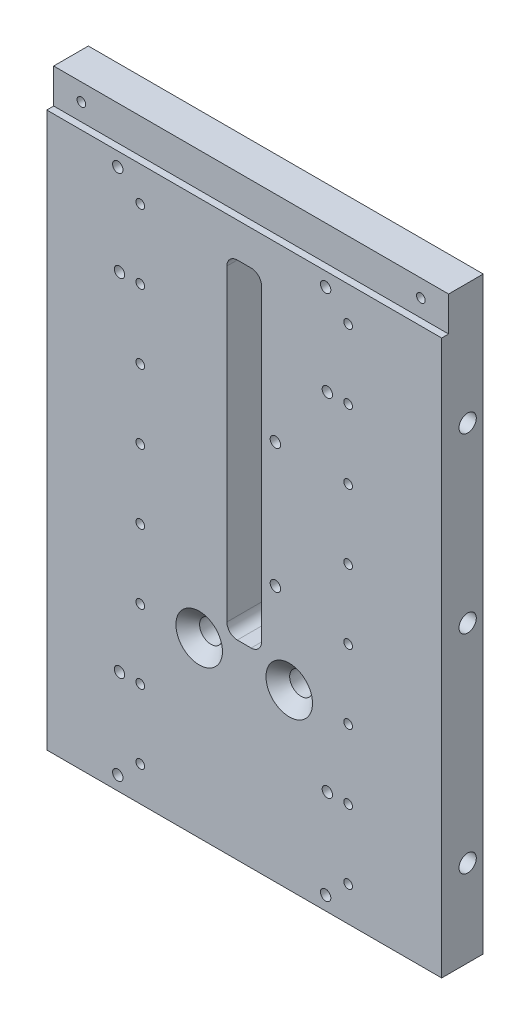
ISO-10303-21;
HEADER;
FILE_DESCRIPTION(('STEP AP214'),'2;1');
FILE_NAME('part.step','',(''),(''),'','','');
FILE_SCHEMA(('AUTOMOTIVE_DESIGN { 1 0 10303 214 1 1 1 1 }'));
ENDSEC;
DATA;
#1=APPLICATION_CONTEXT('core data for automotive mechanical design processes');
#2=APPLICATION_PROTOCOL_DEFINITION('international standard','automotive_design',2000,#1);
#3=PRODUCT_CONTEXT('',#1,'mechanical');
#4=PRODUCT('Part','Part','',(#3));
#5=PRODUCT_RELATED_PRODUCT_CATEGORY('part','',(#4));
#6=PRODUCT_DEFINITION_FORMATION('','',#4);
#7=PRODUCT_DEFINITION_CONTEXT('part definition',#1,'design');
#8=PRODUCT_DEFINITION('design','',#6,#7);
#9=PRODUCT_DEFINITION_SHAPE('','',#8);
#10=(LENGTH_UNIT() NAMED_UNIT(*) SI_UNIT(.MILLI.,.METRE.));
#11=(NAMED_UNIT(*) PLANE_ANGLE_UNIT() SI_UNIT($,.RADIAN.));
#12=(NAMED_UNIT(*) SI_UNIT($,.STERADIAN.) SOLID_ANGLE_UNIT());
#13=UNCERTAINTY_MEASURE_WITH_UNIT(LENGTH_MEASURE(1.E-05),#10,'distance_accuracy_value','');
#14=(GEOMETRIC_REPRESENTATION_CONTEXT(3) GLOBAL_UNCERTAINTY_ASSIGNED_CONTEXT((#13)) GLOBAL_UNIT_ASSIGNED_CONTEXT((#10,
#11,#12)) REPRESENTATION_CONTEXT('',''));
#15=CARTESIAN_POINT('',(0.,0.,0.));
#16=DIRECTION('',(0.,0.,1.));
#17=DIRECTION('',(1.,0.,0.));
#18=AXIS2_PLACEMENT_3D('',#15,#16,#17);
#19=CARTESIAN_POINT('',(-57.,-85.,6.));
#20=DIRECTION('',(1.,0.,0.));
#21=DIRECTION('',(0.,0.,-1.));
#22=AXIS2_PLACEMENT_3D('',#19,#20,#21);
#23=PLANE('',#22);
#24=CARTESIAN_POINT('',(-57.,50.,-1.49999999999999));
#25=DIRECTION('',(-1.,0.,0.));
#26=DIRECTION('',(0.,0.,1.));
#27=AXIS2_PLACEMENT_3D('',#24,#25,#26);
#28=CIRCLE('',#27,2.49999999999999);
#29=CARTESIAN_POINT('',(-57.,50.,0.999999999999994));
#30=VERTEX_POINT('',#29);
#31=EDGE_CURVE('E403',#30,#30,#28,.T.);
#32=ORIENTED_EDGE('',*,*,#31,.F.);
#33=EDGE_LOOP('',(#32));
#34=FACE_BOUND('',#33,.T.);
#35=CARTESIAN_POINT('',(-57.,0.,-1.49999999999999));
#36=DIRECTION('',(-1.,0.,0.));
#37=DIRECTION('',(0.,0.,1.));
#38=AXIS2_PLACEMENT_3D('',#35,#36,#37);
#39=CIRCLE('',#38,2.49999999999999);
#40=CARTESIAN_POINT('',(-57.,0.,0.999999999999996));
#41=VERTEX_POINT('',#40);
#42=EDGE_CURVE('E409',#41,#41,#39,.T.);
#43=ORIENTED_EDGE('',*,*,#42,.F.);
#44=EDGE_LOOP('',(#43));
#45=FACE_BOUND('',#44,.T.);
#46=CARTESIAN_POINT('',(-57.,-60.,-1.49999999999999));
#47=DIRECTION('',(-1.,0.,0.));
#48=DIRECTION('',(0.,0.,1.));
#49=AXIS2_PLACEMENT_3D('',#46,#47,#48);
#50=CIRCLE('',#49,2.49999999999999);
#51=CARTESIAN_POINT('',(-57.,-60.,1.));
#52=VERTEX_POINT('',#51);
#53=EDGE_CURVE('E415',#52,#52,#50,.T.);
#54=ORIENTED_EDGE('',*,*,#53,.F.);
#55=EDGE_LOOP('',(#54));
#56=FACE_BOUND('',#55,.T.);
#57=DIRECTION('',(0.,0.,-1.));
#58=VECTOR('',#57,1.);
#59=CARTESIAN_POINT('',(-57.,75.,6.));
#60=LINE('',#59,#58);
#61=CARTESIAN_POINT('',(-57.,75.,6.));
#62=VERTEX_POINT('',#61);
#63=CARTESIAN_POINT('',(-57.,75.,4.));
#64=VERTEX_POINT('',#63);
#65=EDGE_CURVE('E94',#62,#64,#60,.T.);
#66=ORIENTED_EDGE('',*,*,#65,.T.);
#67=DIRECTION('',(0.,1.,0.));
#68=VECTOR('',#67,1.);
#69=CARTESIAN_POINT('',(-57.,75.,4.));
#70=LINE('',#69,#68);
#71=CARTESIAN_POINT('',(-57.,85.,4.));
#72=VERTEX_POINT('',#71);
#73=EDGE_CURVE('E459',#64,#72,#70,.T.);
#74=ORIENTED_EDGE('',*,*,#73,.T.);
#75=DIRECTION('',(0.,0.,-1.));
#76=VECTOR('',#75,1.);
#77=CARTESIAN_POINT('',(-57.,85.,6.));
#78=LINE('',#77,#76);
#79=CARTESIAN_POINT('',(-57.,85.,-6.));
#80=VERTEX_POINT('',#79);
#81=EDGE_CURVE('E505',#72,#80,#78,.T.);
#82=ORIENTED_EDGE('',*,*,#81,.T.);
#83=DIRECTION('',(0.,-1.,0.));
#84=VECTOR('',#83,1.);
#85=CARTESIAN_POINT('',(-57.,-85.,-6.));
#86=LINE('',#85,#84);
#87=CARTESIAN_POINT('',(-57.,-85.,-6.));
#88=VERTEX_POINT('',#87);
#89=EDGE_CURVE('E487',#80,#88,#86,.T.);
#90=ORIENTED_EDGE('',*,*,#89,.T.);
#91=DIRECTION('',(0.,0.,-1.));
#92=VECTOR('',#91,1.);
#93=CARTESIAN_POINT('',(-57.,-85.,6.));
#94=LINE('',#93,#92);
#95=CARTESIAN_POINT('',(-57.,-85.,6.));
#96=VERTEX_POINT('',#95);
#97=EDGE_CURVE('E521',#96,#88,#94,.T.);
#98=ORIENTED_EDGE('',*,*,#97,.F.);
#99=DIRECTION('',(0.,-1.,0.));
#100=VECTOR('',#99,1.);
#101=CARTESIAN_POINT('',(-57.,-85.,6.));
#102=LINE('',#101,#100);
#103=EDGE_CURVE('E497',#62,#96,#102,.T.);
#104=ORIENTED_EDGE('',*,*,#103,.F.);
#105=EDGE_LOOP('',(#66,#74,#82,#90,#98,#104));
#106=FACE_BOUND('',#105,.T.);
#107=ADVANCED_FACE('F77',(#34,#45,#56,#106),#23,.F.);
#108=CARTESIAN_POINT('',(57.,-85.,6.));
#109=DIRECTION('',(0.,1.,0.));
#110=DIRECTION('',(-1.,0.,0.));
#111=AXIS2_PLACEMENT_3D('',#108,#109,#110);
#112=PLANE('',#111);
#113=DIRECTION('',(1.,0.,0.));
#114=VECTOR('',#113,1.);
#115=CARTESIAN_POINT('',(57.,-85.,-6.));
#116=LINE('',#115,#114);
#117=CARTESIAN_POINT('',(57.,-85.,-6.));
#118=VERTEX_POINT('',#117);
#119=EDGE_CURVE('E508',#88,#118,#116,.T.);
#120=ORIENTED_EDGE('',*,*,#119,.T.);
#121=DIRECTION('',(0.,0.,-1.));
#122=VECTOR('',#121,1.);
#123=CARTESIAN_POINT('',(57.,-85.,6.));
#124=LINE('',#123,#122);
#125=CARTESIAN_POINT('',(57.,-85.,6.));
#126=VERTEX_POINT('',#125);
#127=EDGE_CURVE('E518',#126,#118,#124,.T.);
#128=ORIENTED_EDGE('',*,*,#127,.F.);
#129=DIRECTION('',(1.,0.,0.));
#130=VECTOR('',#129,1.);
#131=CARTESIAN_POINT('',(57.,-85.,6.));
#132=LINE('',#131,#130);
#133=EDGE_CURVE('E499',#96,#126,#132,.T.);
#134=ORIENTED_EDGE('',*,*,#133,.F.);
#135=ORIENTED_EDGE('',*,*,#97,.T.);
#136=EDGE_LOOP('',(#120,#128,#134,#135));
#137=FACE_BOUND('',#136,.T.);
#138=ADVANCED_FACE('F578',(#137),#112,.F.);
#139=CARTESIAN_POINT('',(57.,-85.,6.));
#140=DIRECTION('',(-1.,0.,0.));
#141=DIRECTION('',(0.,0.,1.));
#142=AXIS2_PLACEMENT_3D('',#139,#140,#141);
#143=PLANE('',#142);
#144=CARTESIAN_POINT('',(57.,50.,-1.49999999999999));
#145=DIRECTION('',(1.,0.,0.));
#146=DIRECTION('',(0.,0.,-1.));
#147=AXIS2_PLACEMENT_3D('',#144,#145,#146);
#148=CIRCLE('',#147,2.49999999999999);
#149=CARTESIAN_POINT('',(57.,50.,-3.99999999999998));
#150=VERTEX_POINT('',#149);
#151=EDGE_CURVE('E421',#150,#150,#148,.T.);
#152=ORIENTED_EDGE('',*,*,#151,.F.);
#153=EDGE_LOOP('',(#152));
#154=FACE_BOUND('',#153,.T.);
#155=CARTESIAN_POINT('',(57.,0.,-1.49999999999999));
#156=DIRECTION('',(1.,0.,0.));
#157=DIRECTION('',(0.,0.,-1.));
#158=AXIS2_PLACEMENT_3D('',#155,#156,#157);
#159=CIRCLE('',#158,2.49999999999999);
#160=CARTESIAN_POINT('',(57.,0.,-3.99999999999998));
#161=VERTEX_POINT('',#160);
#162=EDGE_CURVE('E427',#161,#161,#159,.T.);
#163=ORIENTED_EDGE('',*,*,#162,.F.);
#164=EDGE_LOOP('',(#163));
#165=FACE_BOUND('',#164,.T.);
#166=CARTESIAN_POINT('',(57.,-60.,-1.49999999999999));
#167=DIRECTION('',(1.,0.,0.));
#168=DIRECTION('',(0.,0.,-1.));
#169=AXIS2_PLACEMENT_3D('',#166,#167,#168);
#170=CIRCLE('',#169,2.49999999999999);
#171=CARTESIAN_POINT('',(57.,-60.,-3.99999999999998));
#172=VERTEX_POINT('',#171);
#173=EDGE_CURVE('E433',#172,#172,#170,.T.);
#174=ORIENTED_EDGE('',*,*,#173,.F.);
#175=EDGE_LOOP('',(#174));
#176=FACE_BOUND('',#175,.T.);
#177=DIRECTION('',(0.,0.,-1.));
#178=VECTOR('',#177,1.);
#179=CARTESIAN_POINT('',(57.,85.,6.));
#180=LINE('',#179,#178);
#181=CARTESIAN_POINT('',(57.,85.,4.));
#182=VERTEX_POINT('',#181);
#183=CARTESIAN_POINT('',(57.,85.,-6.));
#184=VERTEX_POINT('',#183);
#185=EDGE_CURVE('E516',#182,#184,#180,.T.);
#186=ORIENTED_EDGE('',*,*,#185,.F.);
#187=DIRECTION('',(0.,1.,0.));
#188=VECTOR('',#187,1.);
#189=CARTESIAN_POINT('',(57.,75.,4.));
#190=LINE('',#189,#188);
#191=CARTESIAN_POINT('',(57.,75.,4.));
#192=VERTEX_POINT('',#191);
#193=EDGE_CURVE('E460',#192,#182,#190,.T.);
#194=ORIENTED_EDGE('',*,*,#193,.F.);
#195=DIRECTION('',(0.,0.,-1.));
#196=VECTOR('',#195,1.);
#197=CARTESIAN_POINT('',(57.,75.,6.));
#198=LINE('',#197,#196);
#199=CARTESIAN_POINT('',(57.,75.,6.));
#200=VERTEX_POINT('',#199);
#201=EDGE_CURVE('E464',#200,#192,#198,.T.);
#202=ORIENTED_EDGE('',*,*,#201,.F.);
#203=DIRECTION('',(0.,1.,0.));
#204=VECTOR('',#203,1.);
#205=CARTESIAN_POINT('',(57.,-85.,6.));
#206=LINE('',#205,#204);
#207=EDGE_CURVE('E502',#126,#200,#206,.T.);
#208=ORIENTED_EDGE('',*,*,#207,.F.);
#209=ORIENTED_EDGE('',*,*,#127,.T.);
#210=DIRECTION('',(0.,1.,0.));
#211=VECTOR('',#210,1.);
#212=CARTESIAN_POINT('',(57.,-85.,-6.));
#213=LINE('',#212,#211);
#214=EDGE_CURVE('E510',#118,#184,#213,.T.);
#215=ORIENTED_EDGE('',*,*,#214,.T.);
#216=EDGE_LOOP('',(#186,#194,#202,#208,#209,#215));
#217=FACE_BOUND('',#216,.T.);
#218=ADVANCED_FACE('F584',(#154,#165,#176,#217),#143,.F.);
#219=CARTESIAN_POINT('',(57.,85.,6.));
#220=DIRECTION('',(0.,-1.,0.));
#221=DIRECTION('',(1.,0.,0.));
#222=AXIS2_PLACEMENT_3D('',#219,#220,#221);
#223=PLANE('',#222);
#224=ORIENTED_EDGE('',*,*,#81,.F.);
#225=DIRECTION('',(1.,0.,0.));
#226=VECTOR('',#225,1.);
#227=CARTESIAN_POINT('',(-57.,85.,4.));
#228=LINE('',#227,#226);
#229=EDGE_CURVE('E468',#72,#182,#228,.T.);
#230=ORIENTED_EDGE('',*,*,#229,.T.);
#231=ORIENTED_EDGE('',*,*,#185,.T.);
#232=DIRECTION('',(-1.,0.,0.));
#233=VECTOR('',#232,1.);
#234=CARTESIAN_POINT('',(57.,85.,-6.));
#235=LINE('',#234,#233);
#236=EDGE_CURVE('E500',#184,#80,#235,.T.);
#237=ORIENTED_EDGE('',*,*,#236,.T.);
#238=EDGE_LOOP('',(#224,#230,#231,#237));
#239=FACE_BOUND('',#238,.T.);
#240=ADVANCED_FACE('F648',(#239),#223,.F.);
#241=CARTESIAN_POINT('',(0.,0.,6.));
#242=DIRECTION('',(0.,0.,1.));
#243=DIRECTION('',(1.,0.,0.));
#244=AXIS2_PLACEMENT_3D('',#241,#242,#243);
#245=PLANE('',#244);
#246=CARTESIAN_POINT('',(-36.5,71.,6.));
#247=DIRECTION('',(0.,0.,1.));
#248=DIRECTION('',(1.,0.,0.));
#249=AXIS2_PLACEMENT_3D('',#246,#247,#248);
#250=CIRCLE('',#249,1.49999999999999);
#251=CARTESIAN_POINT('',(-35.,71.,6.));
#252=VERTEX_POINT('',#251);
#253=EDGE_CURVE('E1438',#252,#252,#250,.T.);
#254=ORIENTED_EDGE('',*,*,#253,.F.);
#255=EDGE_LOOP('',(#254));
#256=FACE_BOUND('',#255,.T.);
#257=CARTESIAN_POINT('',(-36.5,-81.,6.));
#258=DIRECTION('',(0.,0.,1.));
#259=DIRECTION('',(1.,0.,0.));
#260=AXIS2_PLACEMENT_3D('',#257,#258,#259);
#261=CIRCLE('',#260,1.49999999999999);
#262=CARTESIAN_POINT('',(-35.,-81.,6.));
#263=VERTEX_POINT('',#262);
#264=EDGE_CURVE('E1440',#263,#263,#261,.T.);
#265=ORIENTED_EDGE('',*,*,#264,.F.);
#266=EDGE_LOOP('',(#265));
#267=FACE_BOUND('',#266,.T.);
#268=CARTESIAN_POINT('',(23.5,-81.,6.));
#269=DIRECTION('',(0.,0.,1.));
#270=DIRECTION('',(1.,0.,0.));
#271=AXIS2_PLACEMENT_3D('',#268,#269,#270);
#272=CIRCLE('',#271,1.49999999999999);
#273=CARTESIAN_POINT('',(25.,-81.,6.));
#274=VERTEX_POINT('',#273);
#275=EDGE_CURVE('E1448',#274,#274,#272,.T.);
#276=ORIENTED_EDGE('',*,*,#275,.F.);
#277=EDGE_LOOP('',(#276));
#278=FACE_BOUND('',#277,.T.);
#279=CARTESIAN_POINT('',(23.5,71.,6.));
#280=DIRECTION('',(0.,0.,1.));
#281=DIRECTION('',(1.,0.,0.));
#282=AXIS2_PLACEMENT_3D('',#279,#280,#281);
#283=CIRCLE('',#282,1.49999999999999);
#284=CARTESIAN_POINT('',(25.,71.,6.));
#285=VERTEX_POINT('',#284);
#286=EDGE_CURVE('E1454',#285,#285,#283,.T.);
#287=ORIENTED_EDGE('',*,*,#286,.F.);
#288=EDGE_LOOP('',(#287));
#289=FACE_BOUND('',#288,.T.);
#290=CARTESIAN_POINT('',(-36.,45.,6.));
#291=DIRECTION('',(0.,0.,1.));
#292=DIRECTION('',(1.,0.,0.));
#293=AXIS2_PLACEMENT_3D('',#290,#291,#292);
#294=CIRCLE('',#293,1.5);
#295=CARTESIAN_POINT('',(-34.5,45.,6.));
#296=VERTEX_POINT('',#295);
#297=EDGE_CURVE('E1460',#296,#296,#294,.T.);
#298=ORIENTED_EDGE('',*,*,#297,.F.);
#299=EDGE_LOOP('',(#298));
#300=FACE_BOUND('',#299,.T.);
#301=CARTESIAN_POINT('',(24.,45.,6.));
#302=DIRECTION('',(0.,0.,1.));
#303=DIRECTION('',(1.,0.,0.));
#304=AXIS2_PLACEMENT_3D('',#301,#302,#303);
#305=CIRCLE('',#304,1.5);
#306=CARTESIAN_POINT('',(25.5,45.,6.));
#307=VERTEX_POINT('',#306);
#308=EDGE_CURVE('E1466',#307,#307,#305,.T.);
#309=ORIENTED_EDGE('',*,*,#308,.F.);
#310=EDGE_LOOP('',(#309));
#311=FACE_BOUND('',#310,.T.);
#312=CARTESIAN_POINT('',(24.,-55.,6.));
#313=DIRECTION('',(0.,0.,1.));
#314=DIRECTION('',(1.,0.,0.));
#315=AXIS2_PLACEMENT_3D('',#312,#313,#314);
#316=CIRCLE('',#315,1.5);
#317=CARTESIAN_POINT('',(25.5,-55.,6.));
#318=VERTEX_POINT('',#317);
#319=EDGE_CURVE('E1472',#318,#318,#316,.T.);
#320=ORIENTED_EDGE('',*,*,#319,.F.);
#321=EDGE_LOOP('',(#320));
#322=FACE_BOUND('',#321,.T.);
#323=CARTESIAN_POINT('',(-36.,-55.,6.));
#324=DIRECTION('',(0.,0.,1.));
#325=DIRECTION('',(1.,0.,0.));
#326=AXIS2_PLACEMENT_3D('',#323,#324,#325);
#327=CIRCLE('',#326,1.5);
#328=CARTESIAN_POINT('',(-34.5,-55.,6.));
#329=VERTEX_POINT('',#328);
#330=EDGE_CURVE('E1478',#329,#329,#327,.T.);
#331=ORIENTED_EDGE('',*,*,#330,.F.);
#332=EDGE_LOOP('',(#331));
#333=FACE_BOUND('',#332,.T.);
#334=CARTESIAN_POINT('',(-30.,65.,6.));
#335=DIRECTION('',(0.,0.,1.));
#336=DIRECTION('',(1.,0.,0.));
#337=AXIS2_PLACEMENT_3D('',#334,#335,#336);
#338=CIRCLE('',#337,1.24999999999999);
#339=CARTESIAN_POINT('',(-28.75,65.,6.));
#340=VERTEX_POINT('',#339);
#341=EDGE_CURVE('E271',#340,#340,#338,.T.);
#342=ORIENTED_EDGE('',*,*,#341,.F.);
#343=EDGE_LOOP('',(#342));
#344=FACE_BOUND('',#343,.T.);
#345=CARTESIAN_POINT('',(-30.,45.,6.));
#346=DIRECTION('',(0.,0.,1.));
#347=DIRECTION('',(1.,0.,0.));
#348=AXIS2_PLACEMENT_3D('',#345,#346,#347);
#349=CIRCLE('',#348,1.24999999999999);
#350=CARTESIAN_POINT('',(-28.75,45.,6.));
#351=VERTEX_POINT('',#350);
#352=EDGE_CURVE('E270',#351,#351,#349,.T.);
#353=ORIENTED_EDGE('',*,*,#352,.F.);
#354=EDGE_LOOP('',(#353));
#355=FACE_BOUND('',#354,.T.);
#356=CARTESIAN_POINT('',(-30.,25.,6.));
#357=DIRECTION('',(0.,0.,1.));
#358=DIRECTION('',(1.,0.,0.));
#359=AXIS2_PLACEMENT_3D('',#356,#357,#358);
#360=CIRCLE('',#359,1.24999999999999);
#361=CARTESIAN_POINT('',(-28.75,25.,6.));
#362=VERTEX_POINT('',#361);
#363=EDGE_CURVE('E283',#362,#362,#360,.T.);
#364=ORIENTED_EDGE('',*,*,#363,.F.);
#365=EDGE_LOOP('',(#364));
#366=FACE_BOUND('',#365,.T.);
#367=CARTESIAN_POINT('',(-30.,5.,6.));
#368=DIRECTION('',(0.,0.,1.));
#369=DIRECTION('',(1.,0.,0.));
#370=AXIS2_PLACEMENT_3D('',#367,#368,#369);
#371=CIRCLE('',#370,1.24999999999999);
#372=CARTESIAN_POINT('',(-28.75,5.,6.));
#373=VERTEX_POINT('',#372);
#374=EDGE_CURVE('E289',#373,#373,#371,.T.);
#375=ORIENTED_EDGE('',*,*,#374,.F.);
#376=EDGE_LOOP('',(#375));
#377=FACE_BOUND('',#376,.T.);
#378=CARTESIAN_POINT('',(-30.,-15.,6.));
#379=DIRECTION('',(0.,0.,1.));
#380=DIRECTION('',(1.,0.,0.));
#381=AXIS2_PLACEMENT_3D('',#378,#379,#380);
#382=CIRCLE('',#381,1.24999999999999);
#383=CARTESIAN_POINT('',(-28.75,-15.,6.));
#384=VERTEX_POINT('',#383);
#385=EDGE_CURVE('E295',#384,#384,#382,.T.);
#386=ORIENTED_EDGE('',*,*,#385,.F.);
#387=EDGE_LOOP('',(#386));
#388=FACE_BOUND('',#387,.T.);
#389=CARTESIAN_POINT('',(-30.,-35.,6.));
#390=DIRECTION('',(0.,0.,1.));
#391=DIRECTION('',(1.,0.,0.));
#392=AXIS2_PLACEMENT_3D('',#389,#390,#391);
#393=CIRCLE('',#392,1.24999999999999);
#394=CARTESIAN_POINT('',(-28.75,-35.,6.));
#395=VERTEX_POINT('',#394);
#396=EDGE_CURVE('E301',#395,#395,#393,.T.);
#397=ORIENTED_EDGE('',*,*,#396,.F.);
#398=EDGE_LOOP('',(#397));
#399=FACE_BOUND('',#398,.T.);
#400=CARTESIAN_POINT('',(-30.,-55.,6.));
#401=DIRECTION('',(0.,0.,1.));
#402=DIRECTION('',(1.,0.,0.));
#403=AXIS2_PLACEMENT_3D('',#400,#401,#402);
#404=CIRCLE('',#403,1.24999999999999);
#405=CARTESIAN_POINT('',(-28.75,-55.,6.));
#406=VERTEX_POINT('',#405);
#407=EDGE_CURVE('E307',#406,#406,#404,.T.);
#408=ORIENTED_EDGE('',*,*,#407,.F.);
#409=EDGE_LOOP('',(#408));
#410=FACE_BOUND('',#409,.T.);
#411=CARTESIAN_POINT('',(-30.,-75.,6.));
#412=DIRECTION('',(0.,0.,1.));
#413=DIRECTION('',(1.,0.,0.));
#414=AXIS2_PLACEMENT_3D('',#411,#412,#413);
#415=CIRCLE('',#414,1.24999999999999);
#416=CARTESIAN_POINT('',(-28.75,-75.,6.));
#417=VERTEX_POINT('',#416);
#418=EDGE_CURVE('E313',#417,#417,#415,.T.);
#419=ORIENTED_EDGE('',*,*,#418,.F.);
#420=EDGE_LOOP('',(#419));
#421=FACE_BOUND('',#420,.T.);
#422=CARTESIAN_POINT('',(30.,-75.,6.));
#423=DIRECTION('',(0.,0.,1.));
#424=DIRECTION('',(1.,0.,0.));
#425=AXIS2_PLACEMENT_3D('',#422,#423,#424);
#426=CIRCLE('',#425,1.24999999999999);
#427=CARTESIAN_POINT('',(31.25,-75.,6.));
#428=VERTEX_POINT('',#427);
#429=EDGE_CURVE('E319',#428,#428,#426,.T.);
#430=ORIENTED_EDGE('',*,*,#429,.F.);
#431=EDGE_LOOP('',(#430));
#432=FACE_BOUND('',#431,.T.);
#433=CARTESIAN_POINT('',(30.,-55.,6.));
#434=DIRECTION('',(0.,0.,1.));
#435=DIRECTION('',(1.,0.,0.));
#436=AXIS2_PLACEMENT_3D('',#433,#434,#435);
#437=CIRCLE('',#436,1.24999999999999);
#438=CARTESIAN_POINT('',(31.25,-55.,6.));
#439=VERTEX_POINT('',#438);
#440=EDGE_CURVE('E325',#439,#439,#437,.T.);
#441=ORIENTED_EDGE('',*,*,#440,.F.);
#442=EDGE_LOOP('',(#441));
#443=FACE_BOUND('',#442,.T.);
#444=CARTESIAN_POINT('',(30.,-35.,6.));
#445=DIRECTION('',(0.,0.,1.));
#446=DIRECTION('',(1.,0.,0.));
#447=AXIS2_PLACEMENT_3D('',#444,#445,#446);
#448=CIRCLE('',#447,1.24999999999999);
#449=CARTESIAN_POINT('',(31.25,-35.,6.));
#450=VERTEX_POINT('',#449);
#451=EDGE_CURVE('E331',#450,#450,#448,.T.);
#452=ORIENTED_EDGE('',*,*,#451,.F.);
#453=EDGE_LOOP('',(#452));
#454=FACE_BOUND('',#453,.T.);
#455=CARTESIAN_POINT('',(30.,-15.,6.));
#456=DIRECTION('',(0.,0.,1.));
#457=DIRECTION('',(1.,0.,0.));
#458=AXIS2_PLACEMENT_3D('',#455,#456,#457);
#459=CIRCLE('',#458,1.24999999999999);
#460=CARTESIAN_POINT('',(31.25,-15.,6.));
#461=VERTEX_POINT('',#460);
#462=EDGE_CURVE('E337',#461,#461,#459,.T.);
#463=ORIENTED_EDGE('',*,*,#462,.F.);
#464=EDGE_LOOP('',(#463));
#465=FACE_BOUND('',#464,.T.);
#466=CARTESIAN_POINT('',(30.,5.,6.));
#467=DIRECTION('',(0.,0.,1.));
#468=DIRECTION('',(1.,0.,0.));
#469=AXIS2_PLACEMENT_3D('',#466,#467,#468);
#470=CIRCLE('',#469,1.24999999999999);
#471=CARTESIAN_POINT('',(31.25,5.,6.));
#472=VERTEX_POINT('',#471);
#473=EDGE_CURVE('E343',#472,#472,#470,.T.);
#474=ORIENTED_EDGE('',*,*,#473,.F.);
#475=EDGE_LOOP('',(#474));
#476=FACE_BOUND('',#475,.T.);
#477=CARTESIAN_POINT('',(30.,25.,6.));
#478=DIRECTION('',(0.,0.,1.));
#479=DIRECTION('',(1.,0.,0.));
#480=AXIS2_PLACEMENT_3D('',#477,#478,#479);
#481=CIRCLE('',#480,1.24999999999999);
#482=CARTESIAN_POINT('',(31.25,25.,6.));
#483=VERTEX_POINT('',#482);
#484=EDGE_CURVE('E349',#483,#483,#481,.T.);
#485=ORIENTED_EDGE('',*,*,#484,.F.);
#486=EDGE_LOOP('',(#485));
#487=FACE_BOUND('',#486,.T.);
#488=CARTESIAN_POINT('',(30.,45.,6.));
#489=DIRECTION('',(0.,0.,1.));
#490=DIRECTION('',(1.,0.,0.));
#491=AXIS2_PLACEMENT_3D('',#488,#489,#490);
#492=CIRCLE('',#491,1.24999999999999);
#493=CARTESIAN_POINT('',(31.25,45.,6.));
#494=VERTEX_POINT('',#493);
#495=EDGE_CURVE('E355',#494,#494,#492,.T.);
#496=ORIENTED_EDGE('',*,*,#495,.F.);
#497=EDGE_LOOP('',(#496));
#498=FACE_BOUND('',#497,.T.);
#499=CARTESIAN_POINT('',(30.,65.,6.));
#500=DIRECTION('',(0.,0.,1.));
#501=DIRECTION('',(1.,0.,0.));
#502=AXIS2_PLACEMENT_3D('',#499,#500,#501);
#503=CIRCLE('',#502,1.24999999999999);
#504=CARTESIAN_POINT('',(31.25,65.,6.));
#505=VERTEX_POINT('',#504);
#506=EDGE_CURVE('E361',#505,#505,#503,.T.);
#507=ORIENTED_EDGE('',*,*,#506,.F.);
#508=EDGE_LOOP('',(#507));
#509=FACE_BOUND('',#508,.T.);
#510=CARTESIAN_POINT('',(-13.,-35.,6.));
#511=DIRECTION('',(0.,0.,1.));
#512=DIRECTION('',(1.,0.,0.));
#513=AXIS2_PLACEMENT_3D('',#510,#511,#512);
#514=CIRCLE('',#513,6.72);
#515=CARTESIAN_POINT('',(-6.28,-35.,6.));
#516=VERTEX_POINT('',#515);
#517=EDGE_CURVE('E385',#516,#516,#514,.T.);
#518=ORIENTED_EDGE('',*,*,#517,.F.);
#519=EDGE_LOOP('',(#518));
#520=FACE_BOUND('',#519,.T.);
#521=CARTESIAN_POINT('',(13.,-35.,6.));
#522=DIRECTION('',(0.,0.,1.));
#523=DIRECTION('',(1.,0.,0.));
#524=AXIS2_PLACEMENT_3D('',#521,#522,#523);
#525=CIRCLE('',#524,6.72);
#526=CARTESIAN_POINT('',(19.72,-35.,6.));
#527=VERTEX_POINT('',#526);
#528=EDGE_CURVE('E394',#527,#527,#525,.T.);
#529=ORIENTED_EDGE('',*,*,#528,.F.);
#530=EDGE_LOOP('',(#529));
#531=FACE_BOUND('',#530,.T.);
#532=CARTESIAN_POINT('',(8.99999999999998,25.,6.));
#533=DIRECTION('',(0.,0.,-1.));
#534=DIRECTION('',(-1.,0.,0.));
#535=AXIS2_PLACEMENT_3D('',#532,#533,#534);
#536=CIRCLE('',#535,1.5);
#537=CARTESIAN_POINT('',(7.49999999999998,25.,6.));
#538=VERTEX_POINT('',#537);
#539=EDGE_CURVE('E442',#538,#538,#536,.T.);
#540=ORIENTED_EDGE('',*,*,#539,.T.);
#541=EDGE_LOOP('',(#540));
#542=FACE_BOUND('',#541,.T.);
#543=CARTESIAN_POINT('',(8.99999999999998,-11.,6.));
#544=DIRECTION('',(0.,0.,-1.));
#545=DIRECTION('',(-1.,0.,0.));
#546=AXIS2_PLACEMENT_3D('',#543,#544,#545);
#547=CIRCLE('',#546,1.5);
#548=CARTESIAN_POINT('',(7.49999999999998,-11.,6.));
#549=VERTEX_POINT('',#548);
#550=EDGE_CURVE('E448',#549,#549,#547,.T.);
#551=ORIENTED_EDGE('',*,*,#550,.T.);
#552=EDGE_LOOP('',(#551));
#553=FACE_BOUND('',#552,.T.);
#554=DIRECTION('',(1.,0.,0.));
#555=VECTOR('',#554,1.);
#556=CARTESIAN_POINT('',(-57.,75.,6.));
#557=LINE('',#556,#555);
#558=EDGE_CURVE('E463',#62,#200,#557,.T.);
#559=ORIENTED_EDGE('',*,*,#558,.F.);
#560=ORIENTED_EDGE('',*,*,#103,.T.);
#561=ORIENTED_EDGE('',*,*,#133,.T.);
#562=ORIENTED_EDGE('',*,*,#207,.T.);
#563=EDGE_LOOP('',(#559,#560,#561,#562));
#564=FACE_BOUND('',#563,.T.);
#565=DIRECTION('',(1.,0.,0.));
#566=VECTOR('',#565,1.);
#567=CARTESIAN_POINT('',(5.,65.,6.));
#568=LINE('',#567,#566);
#569=CARTESIAN_POINT('',(-2.,65.,6.));
#570=VERTEX_POINT('',#569);
#571=CARTESIAN_POINT('',(2.,65.,6.));
#572=VERTEX_POINT('',#571);
#573=EDGE_CURVE('E484',#570,#572,#568,.T.);
#574=ORIENTED_EDGE('',*,*,#573,.T.);
#575=CARTESIAN_POINT('',(2.,62.,6.));
#576=DIRECTION('',(0.,0.,1.));
#577=DIRECTION('',(1.,0.,0.));
#578=AXIS2_PLACEMENT_3D('',#575,#576,#577);
#579=CIRCLE('',#578,3.);
#580=CARTESIAN_POINT('',(5.,62.,6.));
#581=VERTEX_POINT('',#580);
#582=EDGE_CURVE('E545',#572,#581,#579,.F.);
#583=ORIENTED_EDGE('',*,*,#582,.T.);
#584=DIRECTION('',(0.,-1.,0.));
#585=VECTOR('',#584,1.);
#586=CARTESIAN_POINT('',(5.,-30.,6.));
#587=LINE('',#586,#585);
#588=CARTESIAN_POINT('',(5.,-27.,6.));
#589=VERTEX_POINT('',#588);
#590=EDGE_CURVE('E475',#581,#589,#587,.T.);
#591=ORIENTED_EDGE('',*,*,#590,.T.);
#592=CARTESIAN_POINT('',(2.,-27.,6.));
#593=DIRECTION('',(0.,0.,1.));
#594=DIRECTION('',(1.,0.,0.));
#595=AXIS2_PLACEMENT_3D('',#592,#593,#594);
#596=CIRCLE('',#595,3.);
#597=CARTESIAN_POINT('',(2.,-30.,6.));
#598=VERTEX_POINT('',#597);
#599=EDGE_CURVE('E553',#589,#598,#596,.F.);
#600=ORIENTED_EDGE('',*,*,#599,.T.);
#601=DIRECTION('',(-1.,0.,0.));
#602=VECTOR('',#601,1.);
#603=CARTESIAN_POINT('',(5.,-30.,6.));
#604=LINE('',#603,#602);
#605=CARTESIAN_POINT('',(-2.,-30.,6.));
#606=VERTEX_POINT('',#605);
#607=EDGE_CURVE('E478',#598,#606,#604,.T.);
#608=ORIENTED_EDGE('',*,*,#607,.T.);
#609=CARTESIAN_POINT('',(-2.,-27.,6.));
#610=DIRECTION('',(0.,0.,1.));
#611=DIRECTION('',(1.,0.,0.));
#612=AXIS2_PLACEMENT_3D('',#609,#610,#611);
#613=CIRCLE('',#612,3.);
#614=CARTESIAN_POINT('',(-5.,-27.,6.));
#615=VERTEX_POINT('',#614);
#616=EDGE_CURVE('E12',#606,#615,#613,.F.);
#617=ORIENTED_EDGE('',*,*,#616,.T.);
#618=DIRECTION('',(0.,1.,0.));
#619=VECTOR('',#618,1.);
#620=CARTESIAN_POINT('',(-5.,-30.,6.));
#621=LINE('',#620,#619);
#622=CARTESIAN_POINT('',(-5.,62.,6.));
#623=VERTEX_POINT('',#622);
#624=EDGE_CURVE('E481',#615,#623,#621,.T.);
#625=ORIENTED_EDGE('',*,*,#624,.T.);
#626=CARTESIAN_POINT('',(-2.,62.,6.));
#627=DIRECTION('',(0.,0.,1.));
#628=DIRECTION('',(1.,0.,0.));
#629=AXIS2_PLACEMENT_3D('',#626,#627,#628);
#630=CIRCLE('',#629,3.);
#631=EDGE_CURVE('E549',#623,#570,#630,.F.);
#632=ORIENTED_EDGE('',*,*,#631,.T.);
#633=EDGE_LOOP('',(#574,#583,#591,#600,#608,#617,#625,#632));
#634=FACE_BOUND('',#633,.T.);
#635=ADVANCED_FACE('F610',(#256,#267,#278,#289,#300,#311,#322,#333,#344,#355,#366,#377,#388,
#399,#410,#421,#432,#443,#454,#465,#476,#487,#498,#509,#520,#531,#542,#553,#564,#634),#245,.T.);
#636=CARTESIAN_POINT('',(0.,0.,-6.));
#637=DIRECTION('',(0.,0.,1.));
#638=DIRECTION('',(1.,0.,0.));
#639=AXIS2_PLACEMENT_3D('',#636,#637,#638);
#640=PLANE('',#639);
#641=CARTESIAN_POINT('',(-36.5,71.,-6.));
#642=DIRECTION('',(0.,0.,1.));
#643=DIRECTION('',(1.,0.,0.));
#644=AXIS2_PLACEMENT_3D('',#641,#642,#643);
#645=CIRCLE('',#644,1.5);
#646=CARTESIAN_POINT('',(-35.,71.,-6.));
#647=VERTEX_POINT('',#646);
#648=EDGE_CURVE('E1435',#647,#647,#645,.T.);
#649=ORIENTED_EDGE('',*,*,#648,.T.);
#650=EDGE_LOOP('',(#649));
#651=FACE_BOUND('',#650,.T.);
#652=CARTESIAN_POINT('',(-36.5,-81.,-6.));
#653=DIRECTION('',(0.,0.,1.));
#654=DIRECTION('',(1.,0.,0.));
#655=AXIS2_PLACEMENT_3D('',#652,#653,#654);
#656=CIRCLE('',#655,1.5);
#657=CARTESIAN_POINT('',(-35.,-81.,-6.));
#658=VERTEX_POINT('',#657);
#659=EDGE_CURVE('E1445',#658,#658,#656,.T.);
#660=ORIENTED_EDGE('',*,*,#659,.T.);
#661=EDGE_LOOP('',(#660));
#662=FACE_BOUND('',#661,.T.);
#663=CARTESIAN_POINT('',(23.5,-81.,-6.));
#664=DIRECTION('',(0.,0.,1.));
#665=DIRECTION('',(1.,0.,0.));
#666=AXIS2_PLACEMENT_3D('',#663,#664,#665);
#667=CIRCLE('',#666,1.5);
#668=CARTESIAN_POINT('',(25.,-81.,-6.));
#669=VERTEX_POINT('',#668);
#670=EDGE_CURVE('E1451',#669,#669,#667,.T.);
#671=ORIENTED_EDGE('',*,*,#670,.T.);
#672=EDGE_LOOP('',(#671));
#673=FACE_BOUND('',#672,.T.);
#674=CARTESIAN_POINT('',(23.5,71.,-6.));
#675=DIRECTION('',(0.,0.,1.));
#676=DIRECTION('',(1.,0.,0.));
#677=AXIS2_PLACEMENT_3D('',#674,#675,#676);
#678=CIRCLE('',#677,1.5);
#679=CARTESIAN_POINT('',(25.,71.,-6.));
#680=VERTEX_POINT('',#679);
#681=EDGE_CURVE('E1457',#680,#680,#678,.T.);
#682=ORIENTED_EDGE('',*,*,#681,.T.);
#683=EDGE_LOOP('',(#682));
#684=FACE_BOUND('',#683,.T.);
#685=CARTESIAN_POINT('',(-36.,45.,-6.));
#686=DIRECTION('',(0.,0.,1.));
#687=DIRECTION('',(1.,0.,0.));
#688=AXIS2_PLACEMENT_3D('',#685,#686,#687);
#689=CIRCLE('',#688,1.49999999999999);
#690=CARTESIAN_POINT('',(-34.5,45.,-6.));
#691=VERTEX_POINT('',#690);
#692=EDGE_CURVE('E1463',#691,#691,#689,.T.);
#693=ORIENTED_EDGE('',*,*,#692,.T.);
#694=EDGE_LOOP('',(#693));
#695=FACE_BOUND('',#694,.T.);
#696=CARTESIAN_POINT('',(24.,45.,-6.));
#697=DIRECTION('',(0.,0.,1.));
#698=DIRECTION('',(1.,0.,0.));
#699=AXIS2_PLACEMENT_3D('',#696,#697,#698);
#700=CIRCLE('',#699,1.5);
#701=CARTESIAN_POINT('',(25.5,45.,-6.));
#702=VERTEX_POINT('',#701);
#703=EDGE_CURVE('E1469',#702,#702,#700,.T.);
#704=ORIENTED_EDGE('',*,*,#703,.T.);
#705=EDGE_LOOP('',(#704));
#706=FACE_BOUND('',#705,.T.);
#707=CARTESIAN_POINT('',(24.,-55.,-6.));
#708=DIRECTION('',(0.,0.,1.));
#709=DIRECTION('',(1.,0.,0.));
#710=AXIS2_PLACEMENT_3D('',#707,#708,#709);
#711=CIRCLE('',#710,1.5);
#712=CARTESIAN_POINT('',(25.5,-55.,-6.));
#713=VERTEX_POINT('',#712);
#714=EDGE_CURVE('E1475',#713,#713,#711,.T.);
#715=ORIENTED_EDGE('',*,*,#714,.T.);
#716=EDGE_LOOP('',(#715));
#717=FACE_BOUND('',#716,.T.);
#718=CARTESIAN_POINT('',(-36.,-55.,-6.));
#719=DIRECTION('',(0.,0.,1.));
#720=DIRECTION('',(1.,0.,0.));
#721=AXIS2_PLACEMENT_3D('',#718,#719,#720);
#722=CIRCLE('',#721,1.49999999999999);
#723=CARTESIAN_POINT('',(-34.5,-55.,-6.));
#724=VERTEX_POINT('',#723);
#725=EDGE_CURVE('E277',#724,#724,#722,.T.);
#726=ORIENTED_EDGE('',*,*,#725,.T.);
#727=EDGE_LOOP('',(#726));
#728=FACE_BOUND('',#727,.T.);
#729=CARTESIAN_POINT('',(-38.4042043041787,57.5,-6.));
#730=DIRECTION('',(0.,0.,-1.));
#731=DIRECTION('',(-1.,0.,0.));
#732=AXIS2_PLACEMENT_3D('',#729,#730,#731);
#733=CIRCLE('',#732,1.24999999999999);
#734=CARTESIAN_POINT('',(-39.6542043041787,57.5,-6.));
#735=VERTEX_POINT('',#734);
#736=EDGE_CURVE('E367',#735,#735,#733,.T.);
#737=ORIENTED_EDGE('',*,*,#736,.F.);
#738=EDGE_LOOP('',(#737));
#739=FACE_BOUND('',#738,.T.);
#740=CARTESIAN_POINT('',(-38.4042043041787,17.4999999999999,-6.));
#741=DIRECTION('',(0.,0.,-1.));
#742=DIRECTION('',(-1.,0.,0.));
#743=AXIS2_PLACEMENT_3D('',#740,#741,#742);
#744=CIRCLE('',#743,1.24999999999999);
#745=CARTESIAN_POINT('',(-39.6542043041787,17.4999999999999,-6.));
#746=VERTEX_POINT('',#745);
#747=EDGE_CURVE('E373',#746,#746,#744,.T.);
#748=ORIENTED_EDGE('',*,*,#747,.F.);
#749=EDGE_LOOP('',(#748));
#750=FACE_BOUND('',#749,.T.);
#751=CARTESIAN_POINT('',(-38.4042043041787,-22.5000000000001,-6.));
#752=DIRECTION('',(0.,0.,-1.));
#753=DIRECTION('',(-1.,0.,0.));
#754=AXIS2_PLACEMENT_3D('',#751,#752,#753);
#755=CIRCLE('',#754,1.24999999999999);
#756=CARTESIAN_POINT('',(-39.6542043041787,-22.5000000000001,-6.));
#757=VERTEX_POINT('',#756);
#758=EDGE_CURVE('E379',#757,#757,#755,.T.);
#759=ORIENTED_EDGE('',*,*,#758,.F.);
#760=EDGE_LOOP('',(#759));
#761=FACE_BOUND('',#760,.T.);
#762=CARTESIAN_POINT('',(-13.,-35.,-6.));
#763=DIRECTION('',(0.,0.,1.));
#764=DIRECTION('',(1.,0.,0.));
#765=AXIS2_PLACEMENT_3D('',#762,#763,#764);
#766=CIRCLE('',#765,3.3);
#767=CARTESIAN_POINT('',(-9.7,-35.,-6.));
#768=VERTEX_POINT('',#767);
#769=EDGE_CURVE('E391',#768,#768,#766,.T.);
#770=ORIENTED_EDGE('',*,*,#769,.T.);
#771=EDGE_LOOP('',(#770));
#772=FACE_BOUND('',#771,.T.);
#773=CARTESIAN_POINT('',(13.,-35.,-6.));
#774=DIRECTION('',(0.,0.,1.));
#775=DIRECTION('',(1.,0.,0.));
#776=AXIS2_PLACEMENT_3D('',#773,#774,#775);
#777=CIRCLE('',#776,3.3);
#778=CARTESIAN_POINT('',(16.3,-35.,-6.));
#779=VERTEX_POINT('',#778);
#780=EDGE_CURVE('E400',#779,#779,#777,.T.);
#781=ORIENTED_EDGE('',*,*,#780,.T.);
#782=EDGE_LOOP('',(#781));
#783=FACE_BOUND('',#782,.T.);
#784=CARTESIAN_POINT('',(8.99999999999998,25.,-6.));
#785=DIRECTION('',(0.,0.,-1.));
#786=DIRECTION('',(-1.,0.,0.));
#787=AXIS2_PLACEMENT_3D('',#784,#785,#786);
#788=CIRCLE('',#787,1.49999999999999);
#789=CARTESIAN_POINT('',(7.49999999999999,25.,-6.));
#790=VERTEX_POINT('',#789);
#791=EDGE_CURVE('E439',#790,#790,#788,.T.);
#792=ORIENTED_EDGE('',*,*,#791,.F.);
#793=EDGE_LOOP('',(#792));
#794=FACE_BOUND('',#793,.T.);
#795=CARTESIAN_POINT('',(8.99999999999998,-11.,-6.));
#796=DIRECTION('',(0.,0.,-1.));
#797=DIRECTION('',(-1.,0.,0.));
#798=AXIS2_PLACEMENT_3D('',#795,#796,#797);
#799=CIRCLE('',#798,1.49999999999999);
#800=CARTESIAN_POINT('',(7.49999999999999,-11.,-6.));
#801=VERTEX_POINT('',#800);
#802=EDGE_CURVE('E445',#801,#801,#799,.T.);
#803=ORIENTED_EDGE('',*,*,#802,.F.);
#804=EDGE_LOOP('',(#803));
#805=FACE_BOUND('',#804,.T.);
#806=DIRECTION('',(-1.,0.,0.));
#807=VECTOR('',#806,1.);
#808=CARTESIAN_POINT('',(5.,-30.,-6.));
#809=LINE('',#808,#807);
#810=CARTESIAN_POINT('',(2.,-30.,-6.));
#811=VERTEX_POINT('',#810);
#812=CARTESIAN_POINT('',(-2.,-30.,-6.));
#813=VERTEX_POINT('',#812);
#814=EDGE_CURVE('E490',#811,#813,#809,.T.);
#815=ORIENTED_EDGE('',*,*,#814,.F.);
#816=CARTESIAN_POINT('',(2.,-27.,-6.));
#817=DIRECTION('',(0.,0.,1.));
#818=DIRECTION('',(1.,0.,0.));
#819=AXIS2_PLACEMENT_3D('',#816,#817,#818);
#820=CIRCLE('',#819,3.);
#821=CARTESIAN_POINT('',(5.,-27.,-6.));
#822=VERTEX_POINT('',#821);
#823=EDGE_CURVE('E551',#811,#822,#820,.T.);
#824=ORIENTED_EDGE('',*,*,#823,.T.);
#825=DIRECTION('',(0.,-1.,0.));
#826=VECTOR('',#825,1.);
#827=CARTESIAN_POINT('',(5.,-30.,-6.));
#828=LINE('',#827,#826);
#829=CARTESIAN_POINT('',(5.,62.,-6.));
#830=VERTEX_POINT('',#829);
#831=EDGE_CURVE('E471',#830,#822,#828,.T.);
#832=ORIENTED_EDGE('',*,*,#831,.F.);
#833=CARTESIAN_POINT('',(2.,62.,-6.));
#834=DIRECTION('',(0.,0.,1.));
#835=DIRECTION('',(1.,0.,0.));
#836=AXIS2_PLACEMENT_3D('',#833,#834,#835);
#837=CIRCLE('',#836,3.);
#838=CARTESIAN_POINT('',(2.,65.,-6.));
#839=VERTEX_POINT('',#838);
#840=EDGE_CURVE('E543',#830,#839,#837,.T.);
#841=ORIENTED_EDGE('',*,*,#840,.T.);
#842=DIRECTION('',(1.,0.,0.));
#843=VECTOR('',#842,1.);
#844=CARTESIAN_POINT('',(5.,65.,-6.));
#845=LINE('',#844,#843);
#846=CARTESIAN_POINT('',(-2.,65.,-6.));
#847=VERTEX_POINT('',#846);
#848=EDGE_CURVE('E479',#847,#839,#845,.T.);
#849=ORIENTED_EDGE('',*,*,#848,.F.);
#850=CARTESIAN_POINT('',(-2.,62.,-6.));
#851=DIRECTION('',(0.,0.,1.));
#852=DIRECTION('',(1.,0.,0.));
#853=AXIS2_PLACEMENT_3D('',#850,#851,#852);
#854=CIRCLE('',#853,3.);
#855=CARTESIAN_POINT('',(-5.,62.,-6.));
#856=VERTEX_POINT('',#855);
#857=EDGE_CURVE('E547',#847,#856,#854,.T.);
#858=ORIENTED_EDGE('',*,*,#857,.T.);
#859=DIRECTION('',(0.,1.,0.));
#860=VECTOR('',#859,1.);
#861=CARTESIAN_POINT('',(-5.,-30.,-6.));
#862=LINE('',#861,#860);
#863=CARTESIAN_POINT('',(-5.,-27.,-6.));
#864=VERTEX_POINT('',#863);
#865=EDGE_CURVE('E492',#864,#856,#862,.T.);
#866=ORIENTED_EDGE('',*,*,#865,.F.);
#867=CARTESIAN_POINT('',(-2.,-27.,-6.));
#868=DIRECTION('',(0.,0.,1.));
#869=DIRECTION('',(1.,0.,0.));
#870=AXIS2_PLACEMENT_3D('',#867,#868,#869);
#871=CIRCLE('',#870,3.);
#872=EDGE_CURVE('E86',#864,#813,#871,.T.);
#873=ORIENTED_EDGE('',*,*,#872,.T.);
#874=EDGE_LOOP('',(#815,#824,#832,#841,#849,#858,#866,#873));
#875=FACE_BOUND('',#874,.T.);
#876=ORIENTED_EDGE('',*,*,#89,.F.);
#877=ORIENTED_EDGE('',*,*,#236,.F.);
#878=ORIENTED_EDGE('',*,*,#214,.F.);
#879=ORIENTED_EDGE('',*,*,#119,.F.);
#880=EDGE_LOOP('',(#876,#877,#878,#879));
#881=FACE_BOUND('',#880,.T.);
#882=ADVANCED_FACE('F615',(#651,#662,#673,#684,#695,#706,#717,#728,#739,#750,#761,#772,#783,
#794,#805,#875,#881),#640,.F.);
#883=CARTESIAN_POINT('',(5.,-30.,6.));
#884=DIRECTION('',(1.,0.,0.));
#885=DIRECTION('',(0.,0.,-1.));
#886=AXIS2_PLACEMENT_3D('',#883,#884,#885);
#887=PLANE('',#886);
#888=ORIENTED_EDGE('',*,*,#590,.F.);
#889=DIRECTION('',(0.,0.,-1.));
#890=VECTOR('',#889,1.);
#891=CARTESIAN_POINT('',(5.,62.,-6.));
#892=LINE('',#891,#890);
#893=EDGE_CURVE('E526',#581,#830,#892,.T.);
#894=ORIENTED_EDGE('',*,*,#893,.T.);
#895=ORIENTED_EDGE('',*,*,#831,.T.);
#896=DIRECTION('',(0.,0.,-1.));
#897=VECTOR('',#896,1.);
#898=CARTESIAN_POINT('',(5.,-27.,6.));
#899=LINE('',#898,#897);
#900=EDGE_CURVE('E524',#822,#589,#899,.F.);
#901=ORIENTED_EDGE('',*,*,#900,.T.);
#902=EDGE_LOOP('',(#888,#894,#895,#901));
#903=FACE_BOUND('',#902,.T.);
#904=ADVANCED_FACE('F634',(#903),#887,.F.);
#905=CARTESIAN_POINT('',(5.,65.,6.));
#906=DIRECTION('',(0.,1.,0.));
#907=DIRECTION('',(-1.,0.,0.));
#908=AXIS2_PLACEMENT_3D('',#905,#906,#907);
#909=PLANE('',#908);
#910=ORIENTED_EDGE('',*,*,#848,.T.);
#911=DIRECTION('',(0.,0.,-1.));
#912=VECTOR('',#911,1.);
#913=CARTESIAN_POINT('',(2.,65.,6.));
#914=LINE('',#913,#912);
#915=EDGE_CURVE('E532',#839,#572,#914,.F.);
#916=ORIENTED_EDGE('',*,*,#915,.T.);
#917=ORIENTED_EDGE('',*,*,#573,.F.);
#918=DIRECTION('',(0.,0.,-1.));
#919=VECTOR('',#918,1.);
#920=CARTESIAN_POINT('',(-2.,65.,-6.));
#921=LINE('',#920,#919);
#922=EDGE_CURVE('E529',#570,#847,#921,.T.);
#923=ORIENTED_EDGE('',*,*,#922,.T.);
#924=EDGE_LOOP('',(#910,#916,#917,#923));
#925=FACE_BOUND('',#924,.T.);
#926=ADVANCED_FACE('F629',(#925),#909,.F.);
#927=CARTESIAN_POINT('',(-5.,-30.,6.));
#928=DIRECTION('',(-1.,0.,0.));
#929=DIRECTION('',(0.,0.,1.));
#930=AXIS2_PLACEMENT_3D('',#927,#928,#929);
#931=PLANE('',#930);
#932=ORIENTED_EDGE('',*,*,#865,.T.);
#933=DIRECTION('',(0.,0.,-1.));
#934=VECTOR('',#933,1.);
#935=CARTESIAN_POINT('',(-5.,62.,6.));
#936=LINE('',#935,#934);
#937=EDGE_CURVE('E537',#856,#623,#936,.F.);
#938=ORIENTED_EDGE('',*,*,#937,.T.);
#939=ORIENTED_EDGE('',*,*,#624,.F.);
#940=DIRECTION('',(0.,0.,-1.));
#941=VECTOR('',#940,1.);
#942=CARTESIAN_POINT('',(-5.,-27.,-6.));
#943=LINE('',#942,#941);
#944=EDGE_CURVE('E534',#615,#864,#943,.T.);
#945=ORIENTED_EDGE('',*,*,#944,.T.);
#946=EDGE_LOOP('',(#932,#938,#939,#945));
#947=FACE_BOUND('',#946,.T.);
#948=ADVANCED_FACE('F622',(#947),#931,.F.);
#949=CARTESIAN_POINT('',(5.,-30.,6.));
#950=DIRECTION('',(0.,-1.,0.));
#951=DIRECTION('',(0.,0.,-1.));
#952=AXIS2_PLACEMENT_3D('',#949,#950,#951);
#953=PLANE('',#952);
#954=ORIENTED_EDGE('',*,*,#607,.F.);
#955=DIRECTION('',(0.,0.,-1.));
#956=VECTOR('',#955,1.);
#957=CARTESIAN_POINT('',(2.,-30.,-6.));
#958=LINE('',#957,#956);
#959=EDGE_CURVE('E540',#598,#811,#958,.T.);
#960=ORIENTED_EDGE('',*,*,#959,.T.);
#961=ORIENTED_EDGE('',*,*,#814,.T.);
#962=DIRECTION('',(0.,0.,-1.));
#963=VECTOR('',#962,1.);
#964=CARTESIAN_POINT('',(-2.,-30.,6.));
#965=LINE('',#964,#963);
#966=EDGE_CURVE('E102',#813,#606,#965,.F.);
#967=ORIENTED_EDGE('',*,*,#966,.T.);
#968=EDGE_LOOP('',(#954,#960,#961,#967));
#969=FACE_BOUND('',#968,.T.);
#970=ADVANCED_FACE('F595',(#969),#953,.F.);
#971=CARTESIAN_POINT('',(2.,62.,6.));
#972=DIRECTION('',(0.,0.,1.));
#973=DIRECTION('',(1.,0.,0.));
#974=AXIS2_PLACEMENT_3D('',#971,#972,#973);
#975=CYLINDRICAL_SURFACE('',#974,3.);
#976=ORIENTED_EDGE('',*,*,#582,.F.);
#977=ORIENTED_EDGE('',*,*,#915,.F.);
#978=ORIENTED_EDGE('',*,*,#840,.F.);
#979=ORIENTED_EDGE('',*,*,#893,.F.);
#980=EDGE_LOOP('',(#976,#977,#978,#979));
#981=FACE_BOUND('',#980,.T.);
#982=ADVANCED_FACE('F591',(#981),#975,.F.);
#983=CARTESIAN_POINT('',(-2.,62.,6.));
#984=DIRECTION('',(0.,0.,1.));
#985=DIRECTION('',(1.,0.,0.));
#986=AXIS2_PLACEMENT_3D('',#983,#984,#985);
#987=CYLINDRICAL_SURFACE('',#986,3.);
#988=ORIENTED_EDGE('',*,*,#631,.F.);
#989=ORIENTED_EDGE('',*,*,#937,.F.);
#990=ORIENTED_EDGE('',*,*,#857,.F.);
#991=ORIENTED_EDGE('',*,*,#922,.F.);
#992=EDGE_LOOP('',(#988,#989,#990,#991));
#993=FACE_BOUND('',#992,.T.);
#994=ADVANCED_FACE('F594',(#993),#987,.F.);
#995=CARTESIAN_POINT('',(2.,-27.,6.));
#996=DIRECTION('',(0.,0.,1.));
#997=DIRECTION('',(1.,0.,0.));
#998=AXIS2_PLACEMENT_3D('',#995,#996,#997);
#999=CYLINDRICAL_SURFACE('',#998,3.);
#1000=ORIENTED_EDGE('',*,*,#599,.F.);
#1001=ORIENTED_EDGE('',*,*,#900,.F.);
#1002=ORIENTED_EDGE('',*,*,#823,.F.);
#1003=ORIENTED_EDGE('',*,*,#959,.F.);
#1004=EDGE_LOOP('',(#1000,#1001,#1002,#1003));
#1005=FACE_BOUND('',#1004,.T.);
#1006=ADVANCED_FACE('F598',(#1005),#999,.F.);
#1007=CARTESIAN_POINT('',(-2.,-27.,6.));
#1008=DIRECTION('',(0.,0.,1.));
#1009=DIRECTION('',(1.,0.,0.));
#1010=AXIS2_PLACEMENT_3D('',#1007,#1008,#1009);
#1011=CYLINDRICAL_SURFACE('',#1010,3.);
#1012=ORIENTED_EDGE('',*,*,#616,.F.);
#1013=ORIENTED_EDGE('',*,*,#966,.F.);
#1014=ORIENTED_EDGE('',*,*,#872,.F.);
#1015=ORIENTED_EDGE('',*,*,#944,.F.);
#1016=EDGE_LOOP('',(#1012,#1013,#1014,#1015));
#1017=FACE_BOUND('',#1016,.T.);
#1018=ADVANCED_FACE('F79',(#1017),#1011,.F.);
#1019=CARTESIAN_POINT('',(-57.,75.,4.));
#1020=DIRECTION('',(0.,0.,-1.));
#1021=DIRECTION('',(-1.,0.,0.));
#1022=AXIS2_PLACEMENT_3D('',#1019,#1020,#1021);
#1023=PLANE('',#1022);
#1024=CARTESIAN_POINT('',(-49.,80.,4.));
#1025=DIRECTION('',(0.,0.,-1.));
#1026=DIRECTION('',(-1.,0.,0.));
#1027=AXIS2_PLACEMENT_3D('',#1024,#1025,#1026);
#1028=CIRCLE('',#1027,1.24999999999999);
#1029=CARTESIAN_POINT('',(-50.25,80.,4.));
#1030=VERTEX_POINT('',#1029);
#1031=EDGE_CURVE('E81',#1030,#1030,#1028,.T.);
#1032=ORIENTED_EDGE('',*,*,#1031,.T.);
#1033=EDGE_LOOP('',(#1032));
#1034=FACE_BOUND('',#1033,.T.);
#1035=CARTESIAN_POINT('',(49.,80.,4.));
#1036=DIRECTION('',(0.,0.,-1.));
#1037=DIRECTION('',(-1.,0.,0.));
#1038=AXIS2_PLACEMENT_3D('',#1035,#1036,#1037);
#1039=CIRCLE('',#1038,1.24999999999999);
#1040=CARTESIAN_POINT('',(47.75,80.,4.));
#1041=VERTEX_POINT('',#1040);
#1042=EDGE_CURVE('E457',#1041,#1041,#1039,.T.);
#1043=ORIENTED_EDGE('',*,*,#1042,.T.);
#1044=EDGE_LOOP('',(#1043));
#1045=FACE_BOUND('',#1044,.T.);
#1046=ORIENTED_EDGE('',*,*,#193,.T.);
#1047=ORIENTED_EDGE('',*,*,#229,.F.);
#1048=ORIENTED_EDGE('',*,*,#73,.F.);
#1049=DIRECTION('',(1.,0.,0.));
#1050=VECTOR('',#1049,1.);
#1051=CARTESIAN_POINT('',(-57.,75.,4.));
#1052=LINE('',#1051,#1050);
#1053=EDGE_CURVE('E472',#64,#192,#1052,.T.);
#1054=ORIENTED_EDGE('',*,*,#1053,.T.);
#1055=EDGE_LOOP('',(#1046,#1047,#1048,#1054));
#1056=FACE_BOUND('',#1055,.T.);
#1057=ADVANCED_FACE('F558',(#1034,#1045,#1056),#1023,.F.);
#1058=CARTESIAN_POINT('',(-57.,75.,6.));
#1059=DIRECTION('',(0.,-1.,0.));
#1060=DIRECTION('',(0.,0.,-1.));
#1061=AXIS2_PLACEMENT_3D('',#1058,#1059,#1060);
#1062=PLANE('',#1061);
#1063=ORIENTED_EDGE('',*,*,#201,.T.);
#1064=ORIENTED_EDGE('',*,*,#1053,.F.);
#1065=ORIENTED_EDGE('',*,*,#65,.F.);
#1066=ORIENTED_EDGE('',*,*,#558,.T.);
#1067=EDGE_LOOP('',(#1063,#1064,#1065,#1066));
#1068=FACE_BOUND('',#1067,.T.);
#1069=ADVANCED_FACE('F564',(#1068),#1062,.F.);
#1070=CARTESIAN_POINT('',(49.,80.,6.));
#1071=DIRECTION('',(0.,0.,1.));
#1072=DIRECTION('',(1.,0.,0.));
#1073=AXIS2_PLACEMENT_3D('',#1070,#1071,#1072);
#1074=CYLINDRICAL_SURFACE('',#1073,1.24999999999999);
#1075=CARTESIAN_POINT('',(49.,80.,-1.5));
#1076=DIRECTION('',(0.,0.,1.));
#1077=DIRECTION('',(1.,0.,0.));
#1078=AXIS2_PLACEMENT_3D('',#1075,#1076,#1077);
#1079=CIRCLE('',#1078,1.25);
#1080=CARTESIAN_POINT('',(50.25,80.,-1.5));
#1081=VERTEX_POINT('',#1080);
#1082=EDGE_CURVE('E454',#1081,#1081,#1079,.T.);
#1083=ORIENTED_EDGE('',*,*,#1082,.F.);
#1084=EDGE_LOOP('',(#1083));
#1085=FACE_BOUND('',#1084,.T.);
#1086=ORIENTED_EDGE('',*,*,#1042,.F.);
#1087=EDGE_LOOP('',(#1086));
#1088=FACE_BOUND('',#1087,.T.);
#1089=ADVANCED_FACE('F561',(#1085,#1088),#1074,.F.);
#1090=CARTESIAN_POINT('',(49.,80.,-1.5));
#1091=DIRECTION('',(0.,0.,1.));
#1092=DIRECTION('',(1.,0.,0.));
#1093=AXIS2_PLACEMENT_3D('',#1090,#1091,#1092);
#1094=CONICAL_SURFACE('',#1093,1.25,1.02974425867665);
#1095=CARTESIAN_POINT('',(49.,80.,-2.25107577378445));
#1096=VERTEX_POINT('',#1095);
#1097=VERTEX_LOOP('',#1096);
#1098=FACE_BOUND('',#1097,.T.);
#1099=ORIENTED_EDGE('',*,*,#1082,.T.);
#1100=EDGE_LOOP('',(#1099));
#1101=FACE_BOUND('',#1100,.T.);
#1102=ADVANCED_FACE('F563',(#1098,#1101),#1094,.F.);
#1103=CARTESIAN_POINT('',(-49.,80.,6.));
#1104=DIRECTION('',(0.,0.,1.));
#1105=DIRECTION('',(1.,0.,0.));
#1106=AXIS2_PLACEMENT_3D('',#1103,#1104,#1105);
#1107=CYLINDRICAL_SURFACE('',#1106,1.24999999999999);
#1108=CARTESIAN_POINT('',(-49.,80.,-1.5));
#1109=DIRECTION('',(0.,0.,1.));
#1110=DIRECTION('',(1.,0.,0.));
#1111=AXIS2_PLACEMENT_3D('',#1108,#1109,#1110);
#1112=CIRCLE('',#1111,1.25);
#1113=CARTESIAN_POINT('',(-47.75,80.,-1.5));
#1114=VERTEX_POINT('',#1113);
#1115=EDGE_CURVE('E451',#1114,#1114,#1112,.T.);
#1116=ORIENTED_EDGE('',*,*,#1115,.F.);
#1117=EDGE_LOOP('',(#1116));
#1118=FACE_BOUND('',#1117,.T.);
#1119=ORIENTED_EDGE('',*,*,#1031,.F.);
#1120=EDGE_LOOP('',(#1119));
#1121=FACE_BOUND('',#1120,.T.);
#1122=ADVANCED_FACE('F571',(#1118,#1121),#1107,.F.);
#1123=CARTESIAN_POINT('',(-49.,80.,-1.5));
#1124=DIRECTION('',(0.,0.,1.));
#1125=DIRECTION('',(1.,0.,0.));
#1126=AXIS2_PLACEMENT_3D('',#1123,#1124,#1125);
#1127=CONICAL_SURFACE('',#1126,1.25,1.02974425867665);
#1128=CARTESIAN_POINT('',(-49.,80.,-2.25107577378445));
#1129=VERTEX_POINT('',#1128);
#1130=VERTEX_LOOP('',#1129);
#1131=FACE_BOUND('',#1130,.T.);
#1132=ORIENTED_EDGE('',*,*,#1115,.T.);
#1133=EDGE_LOOP('',(#1132));
#1134=FACE_BOUND('',#1133,.T.);
#1135=ADVANCED_FACE('F749',(#1131,#1134),#1127,.F.);
#1136=CARTESIAN_POINT('',(8.99999999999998,-11.,-6.));
#1137=DIRECTION('',(0.,0.,-1.));
#1138=DIRECTION('',(-1.,0.,0.));
#1139=AXIS2_PLACEMENT_3D('',#1136,#1137,#1138);
#1140=CYLINDRICAL_SURFACE('',#1139,1.49999999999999);
#1141=ORIENTED_EDGE('',*,*,#550,.F.);
#1142=EDGE_LOOP('',(#1141));
#1143=FACE_BOUND('',#1142,.T.);
#1144=ORIENTED_EDGE('',*,*,#802,.T.);
#1145=EDGE_LOOP('',(#1144));
#1146=FACE_BOUND('',#1145,.T.);
#1147=ADVANCED_FACE('F759',(#1143,#1146),#1140,.F.);
#1148=CARTESIAN_POINT('',(8.99999999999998,25.,-6.));
#1149=DIRECTION('',(0.,0.,-1.));
#1150=DIRECTION('',(-1.,0.,0.));
#1151=AXIS2_PLACEMENT_3D('',#1148,#1149,#1150);
#1152=CYLINDRICAL_SURFACE('',#1151,1.49999999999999);
#1153=ORIENTED_EDGE('',*,*,#539,.F.);
#1154=EDGE_LOOP('',(#1153));
#1155=FACE_BOUND('',#1154,.T.);
#1156=ORIENTED_EDGE('',*,*,#791,.T.);
#1157=EDGE_LOOP('',(#1156));
#1158=FACE_BOUND('',#1157,.T.);
#1159=ADVANCED_FACE('F768',(#1155,#1158),#1152,.F.);
#1160=CARTESIAN_POINT('',(42.,-60.,-1.49999999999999));
#1161=DIRECTION('',(1.,0.,0.));
#1162=DIRECTION('',(0.,0.,-1.));
#1163=AXIS2_PLACEMENT_3D('',#1160,#1161,#1162);
#1164=CONICAL_SURFACE('',#1163,2.49999999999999,1.02974425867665);
#1165=CARTESIAN_POINT('',(40.4978484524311,-60.,-1.49999999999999));
#1166=VERTEX_POINT('',#1165);
#1167=VERTEX_LOOP('',#1166);
#1168=FACE_BOUND('',#1167,.T.);
#1169=CARTESIAN_POINT('',(42.,-60.,-1.49999999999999));
#1170=DIRECTION('',(1.,0.,0.));
#1171=DIRECTION('',(0.,0.,-1.));
#1172=AXIS2_PLACEMENT_3D('',#1169,#1170,#1171);
#1173=CIRCLE('',#1172,2.49999999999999);
#1174=CARTESIAN_POINT('',(42.,-60.,-3.99999999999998));
#1175=VERTEX_POINT('',#1174);
#1176=EDGE_CURVE('E436',#1175,#1175,#1173,.T.);
#1177=ORIENTED_EDGE('',*,*,#1176,.T.);
#1178=EDGE_LOOP('',(#1177));
#1179=FACE_BOUND('',#1178,.T.);
#1180=ADVANCED_FACE('F777',(#1168,#1179),#1164,.F.);
#1181=CARTESIAN_POINT('',(57.,-60.,-1.49999999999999));
#1182=DIRECTION('',(1.,0.,0.));
#1183=DIRECTION('',(0.,0.,-1.));
#1184=AXIS2_PLACEMENT_3D('',#1181,#1182,#1183);
#1185=CYLINDRICAL_SURFACE('',#1184,2.49999999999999);
#1186=ORIENTED_EDGE('',*,*,#1176,.F.);
#1187=EDGE_LOOP('',(#1186));
#1188=FACE_BOUND('',#1187,.T.);
#1189=ORIENTED_EDGE('',*,*,#173,.T.);
#1190=EDGE_LOOP('',(#1189));
#1191=FACE_BOUND('',#1190,.T.);
#1192=ADVANCED_FACE('F792',(#1188,#1191),#1185,.F.);
#1193=CARTESIAN_POINT('',(42.,0.,-1.49999999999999));
#1194=DIRECTION('',(1.,0.,0.));
#1195=DIRECTION('',(0.,0.,-1.));
#1196=AXIS2_PLACEMENT_3D('',#1193,#1194,#1195);
#1197=CONICAL_SURFACE('',#1196,2.49999999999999,1.02974425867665);
#1198=CARTESIAN_POINT('',(40.4978484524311,0.,-1.49999999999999));
#1199=VERTEX_POINT('',#1198);
#1200=VERTEX_LOOP('',#1199);
#1201=FACE_BOUND('',#1200,.T.);
#1202=CARTESIAN_POINT('',(42.,0.,-1.49999999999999));
#1203=DIRECTION('',(1.,0.,0.));
#1204=DIRECTION('',(0.,0.,-1.));
#1205=AXIS2_PLACEMENT_3D('',#1202,#1203,#1204);
#1206=CIRCLE('',#1205,2.49999999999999);
#1207=CARTESIAN_POINT('',(42.,0.,-3.99999999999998));
#1208=VERTEX_POINT('',#1207);
#1209=EDGE_CURVE('E430',#1208,#1208,#1206,.T.);
#1210=ORIENTED_EDGE('',*,*,#1209,.T.);
#1211=EDGE_LOOP('',(#1210));
#1212=FACE_BOUND('',#1211,.T.);
#1213=ADVANCED_FACE('F803',(#1201,#1212),#1197,.F.);
#1214=CARTESIAN_POINT('',(57.,0.,-1.49999999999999));
#1215=DIRECTION('',(1.,0.,0.));
#1216=DIRECTION('',(0.,0.,-1.));
#1217=AXIS2_PLACEMENT_3D('',#1214,#1215,#1216);
#1218=CYLINDRICAL_SURFACE('',#1217,2.49999999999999);
#1219=ORIENTED_EDGE('',*,*,#1209,.F.);
#1220=EDGE_LOOP('',(#1219));
#1221=FACE_BOUND('',#1220,.T.);
#1222=ORIENTED_EDGE('',*,*,#162,.T.);
#1223=EDGE_LOOP('',(#1222));
#1224=FACE_BOUND('',#1223,.T.);
#1225=ADVANCED_FACE('F816',(#1221,#1224),#1218,.F.);
#1226=CARTESIAN_POINT('',(42.,50.,-1.49999999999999));
#1227=DIRECTION('',(1.,0.,0.));
#1228=DIRECTION('',(0.,0.,-1.));
#1229=AXIS2_PLACEMENT_3D('',#1226,#1227,#1228);
#1230=CONICAL_SURFACE('',#1229,2.49999999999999,1.02974425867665);
#1231=CARTESIAN_POINT('',(40.4978484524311,50.,-1.49999999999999));
#1232=VERTEX_POINT('',#1231);
#1233=VERTEX_LOOP('',#1232);
#1234=FACE_BOUND('',#1233,.T.);
#1235=CARTESIAN_POINT('',(42.,50.,-1.49999999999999));
#1236=DIRECTION('',(1.,0.,0.));
#1237=DIRECTION('',(0.,0.,-1.));
#1238=AXIS2_PLACEMENT_3D('',#1235,#1236,#1237);
#1239=CIRCLE('',#1238,2.49999999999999);
#1240=CARTESIAN_POINT('',(42.,50.,-3.99999999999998));
#1241=VERTEX_POINT('',#1240);
#1242=EDGE_CURVE('E424',#1241,#1241,#1239,.T.);
#1243=ORIENTED_EDGE('',*,*,#1242,.T.);
#1244=EDGE_LOOP('',(#1243));
#1245=FACE_BOUND('',#1244,.T.);
#1246=ADVANCED_FACE('F826',(#1234,#1245),#1230,.F.);
#1247=CARTESIAN_POINT('',(57.,50.,-1.49999999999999));
#1248=DIRECTION('',(1.,0.,0.));
#1249=DIRECTION('',(0.,0.,-1.));
#1250=AXIS2_PLACEMENT_3D('',#1247,#1248,#1249);
#1251=CYLINDRICAL_SURFACE('',#1250,2.49999999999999);
#1252=ORIENTED_EDGE('',*,*,#1242,.F.);
#1253=EDGE_LOOP('',(#1252));
#1254=FACE_BOUND('',#1253,.T.);
#1255=ORIENTED_EDGE('',*,*,#151,.T.);
#1256=EDGE_LOOP('',(#1255));
#1257=FACE_BOUND('',#1256,.T.);
#1258=ADVANCED_FACE('F837',(#1254,#1257),#1251,.F.);
#1259=CARTESIAN_POINT('',(-42.,-60.,-1.49999999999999));
#1260=DIRECTION('',(-1.,0.,0.));
#1261=DIRECTION('',(0.,0.,1.));
#1262=AXIS2_PLACEMENT_3D('',#1259,#1260,#1261);
#1263=CONICAL_SURFACE('',#1262,2.49999999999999,1.02974425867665);
#1264=CARTESIAN_POINT('',(-40.4978484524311,-60.,-1.49999999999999));
#1265=VERTEX_POINT('',#1264);
#1266=VERTEX_LOOP('',#1265);
#1267=FACE_BOUND('',#1266,.T.);
#1268=CARTESIAN_POINT('',(-42.,-60.,-1.49999999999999));
#1269=DIRECTION('',(-1.,0.,0.));
#1270=DIRECTION('',(0.,0.,1.));
#1271=AXIS2_PLACEMENT_3D('',#1268,#1269,#1270);
#1272=CIRCLE('',#1271,2.49999999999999);
#1273=CARTESIAN_POINT('',(-42.,-60.,1.));
#1274=VERTEX_POINT('',#1273);
#1275=EDGE_CURVE('E418',#1274,#1274,#1272,.T.);
#1276=ORIENTED_EDGE('',*,*,#1275,.T.);
#1277=EDGE_LOOP('',(#1276));
#1278=FACE_BOUND('',#1277,.T.);
#1279=ADVANCED_FACE('F846',(#1267,#1278),#1263,.F.);
#1280=CARTESIAN_POINT('',(-57.,-60.,-1.49999999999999));
#1281=DIRECTION('',(-1.,0.,0.));
#1282=DIRECTION('',(0.,0.,1.));
#1283=AXIS2_PLACEMENT_3D('',#1280,#1281,#1282);
#1284=CYLINDRICAL_SURFACE('',#1283,2.49999999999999);
#1285=ORIENTED_EDGE('',*,*,#1275,.F.);
#1286=EDGE_LOOP('',(#1285));
#1287=FACE_BOUND('',#1286,.T.);
#1288=ORIENTED_EDGE('',*,*,#53,.T.);
#1289=EDGE_LOOP('',(#1288));
#1290=FACE_BOUND('',#1289,.T.);
#1291=ADVANCED_FACE('F862',(#1287,#1290),#1284,.F.);
#1292=CARTESIAN_POINT('',(-42.,0.,-1.49999999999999));
#1293=DIRECTION('',(-1.,0.,0.));
#1294=DIRECTION('',(0.,0.,1.));
#1295=AXIS2_PLACEMENT_3D('',#1292,#1293,#1294);
#1296=CONICAL_SURFACE('',#1295,2.49999999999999,1.02974425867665);
#1297=CARTESIAN_POINT('',(-40.4978484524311,0.,-1.49999999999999));
#1298=VERTEX_POINT('',#1297);
#1299=VERTEX_LOOP('',#1298);
#1300=FACE_BOUND('',#1299,.T.);
#1301=CARTESIAN_POINT('',(-42.,0.,-1.49999999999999));
#1302=DIRECTION('',(-1.,0.,0.));
#1303=DIRECTION('',(0.,0.,1.));
#1304=AXIS2_PLACEMENT_3D('',#1301,#1302,#1303);
#1305=CIRCLE('',#1304,2.49999999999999);
#1306=CARTESIAN_POINT('',(-42.,0.,0.999999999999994));
#1307=VERTEX_POINT('',#1306);
#1308=EDGE_CURVE('E412',#1307,#1307,#1305,.T.);
#1309=ORIENTED_EDGE('',*,*,#1308,.T.);
#1310=EDGE_LOOP('',(#1309));
#1311=FACE_BOUND('',#1310,.T.);
#1312=ADVANCED_FACE('F873',(#1300,#1311),#1296,.F.);
#1313=CARTESIAN_POINT('',(-57.,0.,-1.49999999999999));
#1314=DIRECTION('',(-1.,0.,0.));
#1315=DIRECTION('',(0.,0.,1.));
#1316=AXIS2_PLACEMENT_3D('',#1313,#1314,#1315);
#1317=CYLINDRICAL_SURFACE('',#1316,2.49999999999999);
#1318=ORIENTED_EDGE('',*,*,#1308,.F.);
#1319=EDGE_LOOP('',(#1318));
#1320=FACE_BOUND('',#1319,.T.);
#1321=ORIENTED_EDGE('',*,*,#42,.T.);
#1322=EDGE_LOOP('',(#1321));
#1323=FACE_BOUND('',#1322,.T.);
#1324=ADVANCED_FACE('F886',(#1320,#1323),#1317,.F.);
#1325=CARTESIAN_POINT('',(-42.,50.,-1.49999999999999));
#1326=DIRECTION('',(-1.,0.,0.));
#1327=DIRECTION('',(0.,0.,1.));
#1328=AXIS2_PLACEMENT_3D('',#1325,#1326,#1327);
#1329=CONICAL_SURFACE('',#1328,2.49999999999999,1.02974425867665);
#1330=CARTESIAN_POINT('',(-40.4978484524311,50.,-1.49999999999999));
#1331=VERTEX_POINT('',#1330);
#1332=VERTEX_LOOP('',#1331);
#1333=FACE_BOUND('',#1332,.T.);
#1334=CARTESIAN_POINT('',(-42.,50.,-1.49999999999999));
#1335=DIRECTION('',(-1.,0.,0.));
#1336=DIRECTION('',(0.,0.,1.));
#1337=AXIS2_PLACEMENT_3D('',#1334,#1335,#1336);
#1338=CIRCLE('',#1337,2.49999999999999);
#1339=CARTESIAN_POINT('',(-42.,50.,0.999999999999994));
#1340=VERTEX_POINT('',#1339);
#1341=EDGE_CURVE('E406',#1340,#1340,#1338,.T.);
#1342=ORIENTED_EDGE('',*,*,#1341,.T.);
#1343=EDGE_LOOP('',(#1342));
#1344=FACE_BOUND('',#1343,.T.);
#1345=ADVANCED_FACE('F896',(#1333,#1344),#1329,.F.);
#1346=CARTESIAN_POINT('',(-57.,50.,-1.49999999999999));
#1347=DIRECTION('',(-1.,0.,0.));
#1348=DIRECTION('',(0.,0.,1.));
#1349=AXIS2_PLACEMENT_3D('',#1346,#1347,#1348);
#1350=CYLINDRICAL_SURFACE('',#1349,2.49999999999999);
#1351=ORIENTED_EDGE('',*,*,#1341,.F.);
#1352=EDGE_LOOP('',(#1351));
#1353=FACE_BOUND('',#1352,.T.);
#1354=ORIENTED_EDGE('',*,*,#31,.T.);
#1355=EDGE_LOOP('',(#1354));
#1356=FACE_BOUND('',#1355,.T.);
#1357=ADVANCED_FACE('F907',(#1353,#1356),#1350,.F.);
#1358=CARTESIAN_POINT('',(13.,-35.,6.));
#1359=DIRECTION('',(0.,0.,1.));
#1360=DIRECTION('',(1.,0.,0.));
#1361=AXIS2_PLACEMENT_3D('',#1358,#1359,#1360);
#1362=CYLINDRICAL_SURFACE('',#1361,3.3);
#1363=ORIENTED_EDGE('',*,*,#780,.F.);
#1364=EDGE_LOOP('',(#1363));
#1365=FACE_BOUND('',#1364,.T.);
#1366=CARTESIAN_POINT('',(13.,-35.,2.58));
#1367=DIRECTION('',(0.,0.,1.));
#1368=DIRECTION('',(1.,0.,0.));
#1369=AXIS2_PLACEMENT_3D('',#1366,#1367,#1368);
#1370=CIRCLE('',#1369,3.3);
#1371=CARTESIAN_POINT('',(16.3,-35.,2.58));
#1372=VERTEX_POINT('',#1371);
#1373=EDGE_CURVE('E397',#1372,#1372,#1370,.T.);
#1374=ORIENTED_EDGE('',*,*,#1373,.T.);
#1375=EDGE_LOOP('',(#1374));
#1376=FACE_BOUND('',#1375,.T.);
#1377=ADVANCED_FACE('F917',(#1365,#1376),#1362,.F.);
#1378=CARTESIAN_POINT('',(13.,-35.,6.));
#1379=DIRECTION('',(0.,0.,1.));
#1380=DIRECTION('',(1.,0.,0.));
#1381=AXIS2_PLACEMENT_3D('',#1378,#1379,#1380);
#1382=CONICAL_SURFACE('',#1381,6.72,0.785398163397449);
#1383=ORIENTED_EDGE('',*,*,#1373,.F.);
#1384=EDGE_LOOP('',(#1383));
#1385=FACE_BOUND('',#1384,.T.);
#1386=ORIENTED_EDGE('',*,*,#528,.T.);
#1387=EDGE_LOOP('',(#1386));
#1388=FACE_BOUND('',#1387,.T.);
#1389=ADVANCED_FACE('F928',(#1385,#1388),#1382,.F.);
#1390=CARTESIAN_POINT('',(-13.,-35.,6.));
#1391=DIRECTION('',(0.,0.,1.));
#1392=DIRECTION('',(1.,0.,0.));
#1393=AXIS2_PLACEMENT_3D('',#1390,#1391,#1392);
#1394=CYLINDRICAL_SURFACE('',#1393,3.3);
#1395=ORIENTED_EDGE('',*,*,#769,.F.);
#1396=EDGE_LOOP('',(#1395));
#1397=FACE_BOUND('',#1396,.T.);
#1398=CARTESIAN_POINT('',(-13.,-35.,2.58));
#1399=DIRECTION('',(0.,0.,1.));
#1400=DIRECTION('',(1.,0.,0.));
#1401=AXIS2_PLACEMENT_3D('',#1398,#1399,#1400);
#1402=CIRCLE('',#1401,3.3);
#1403=CARTESIAN_POINT('',(-9.7,-35.,2.58));
#1404=VERTEX_POINT('',#1403);
#1405=EDGE_CURVE('E388',#1404,#1404,#1402,.T.);
#1406=ORIENTED_EDGE('',*,*,#1405,.T.);
#1407=EDGE_LOOP('',(#1406));
#1408=FACE_BOUND('',#1407,.T.);
#1409=ADVANCED_FACE('F938',(#1397,#1408),#1394,.F.);
#1410=CARTESIAN_POINT('',(-13.,-35.,6.));
#1411=DIRECTION('',(0.,0.,1.));
#1412=DIRECTION('',(1.,0.,0.));
#1413=AXIS2_PLACEMENT_3D('',#1410,#1411,#1412);
#1414=CONICAL_SURFACE('',#1413,6.72,0.785398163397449);
#1415=ORIENTED_EDGE('',*,*,#1405,.F.);
#1416=EDGE_LOOP('',(#1415));
#1417=FACE_BOUND('',#1416,.T.);
#1418=ORIENTED_EDGE('',*,*,#517,.T.);
#1419=EDGE_LOOP('',(#1418));
#1420=FACE_BOUND('',#1419,.T.);
#1421=ADVANCED_FACE('F948',(#1417,#1420),#1414,.F.);
#1422=CARTESIAN_POINT('',(-38.4042043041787,-22.5000000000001,1.49999999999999));
#1423=DIRECTION('',(0.,0.,-1.));
#1424=DIRECTION('',(-1.,0.,0.));
#1425=AXIS2_PLACEMENT_3D('',#1422,#1423,#1424);
#1426=CONICAL_SURFACE('',#1425,1.24999999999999,1.02974425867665);
#1427=CARTESIAN_POINT('',(-38.4042043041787,-22.5000000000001,2.25107577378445));
#1428=VERTEX_POINT('',#1427);
#1429=VERTEX_LOOP('',#1428);
#1430=FACE_BOUND('',#1429,.T.);
#1431=CARTESIAN_POINT('',(-38.4042043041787,-22.5000000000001,1.49999999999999));
#1432=DIRECTION('',(0.,0.,-1.));
#1433=DIRECTION('',(-1.,0.,0.));
#1434=AXIS2_PLACEMENT_3D('',#1431,#1432,#1433);
#1435=CIRCLE('',#1434,1.24999999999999);
#1436=CARTESIAN_POINT('',(-39.6542043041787,-22.5000000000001,1.49999999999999));
#1437=VERTEX_POINT('',#1436);
#1438=EDGE_CURVE('E382',#1437,#1437,#1435,.T.);
#1439=ORIENTED_EDGE('',*,*,#1438,.T.);
#1440=EDGE_LOOP('',(#1439));
#1441=FACE_BOUND('',#1440,.T.);
#1442=ADVANCED_FACE('F958',(#1430,#1441),#1426,.F.);
#1443=CARTESIAN_POINT('',(-38.4042043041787,-22.5000000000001,-6.));
#1444=DIRECTION('',(0.,0.,-1.));
#1445=DIRECTION('',(-1.,0.,0.));
#1446=AXIS2_PLACEMENT_3D('',#1443,#1444,#1445);
#1447=CYLINDRICAL_SURFACE('',#1446,1.24999999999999);
#1448=ORIENTED_EDGE('',*,*,#1438,.F.);
#1449=EDGE_LOOP('',(#1448));
#1450=FACE_BOUND('',#1449,.T.);
#1451=ORIENTED_EDGE('',*,*,#758,.T.);
#1452=EDGE_LOOP('',(#1451));
#1453=FACE_BOUND('',#1452,.T.);
#1454=ADVANCED_FACE('F968',(#1450,#1453),#1447,.F.);
#1455=CARTESIAN_POINT('',(-38.4042043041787,17.4999999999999,1.49999999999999));
#1456=DIRECTION('',(0.,0.,-1.));
#1457=DIRECTION('',(-1.,0.,0.));
#1458=AXIS2_PLACEMENT_3D('',#1455,#1456,#1457);
#1459=CONICAL_SURFACE('',#1458,1.24999999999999,1.02974425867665);
#1460=CARTESIAN_POINT('',(-38.4042043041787,17.4999999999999,2.25107577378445));
#1461=VERTEX_POINT('',#1460);
#1462=VERTEX_LOOP('',#1461);
#1463=FACE_BOUND('',#1462,.T.);
#1464=CARTESIAN_POINT('',(-38.4042043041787,17.4999999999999,1.49999999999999));
#1465=DIRECTION('',(0.,0.,-1.));
#1466=DIRECTION('',(-1.,0.,0.));
#1467=AXIS2_PLACEMENT_3D('',#1464,#1465,#1466);
#1468=CIRCLE('',#1467,1.24999999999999);
#1469=CARTESIAN_POINT('',(-39.6542043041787,17.4999999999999,1.49999999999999));
#1470=VERTEX_POINT('',#1469);
#1471=EDGE_CURVE('E376',#1470,#1470,#1468,.T.);
#1472=ORIENTED_EDGE('',*,*,#1471,.T.);
#1473=EDGE_LOOP('',(#1472));
#1474=FACE_BOUND('',#1473,.T.);
#1475=ADVANCED_FACE('F979',(#1463,#1474),#1459,.F.);
#1476=CARTESIAN_POINT('',(-38.4042043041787,17.4999999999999,-6.));
#1477=DIRECTION('',(0.,0.,-1.));
#1478=DIRECTION('',(-1.,0.,0.));
#1479=AXIS2_PLACEMENT_3D('',#1476,#1477,#1478);
#1480=CYLINDRICAL_SURFACE('',#1479,1.24999999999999);
#1481=ORIENTED_EDGE('',*,*,#1471,.F.);
#1482=EDGE_LOOP('',(#1481));
#1483=FACE_BOUND('',#1482,.T.);
#1484=ORIENTED_EDGE('',*,*,#747,.T.);
#1485=EDGE_LOOP('',(#1484));
#1486=FACE_BOUND('',#1485,.T.);
#1487=ADVANCED_FACE('F991',(#1483,#1486),#1480,.F.);
#1488=CARTESIAN_POINT('',(-38.4042043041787,57.5,1.49999999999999));
#1489=DIRECTION('',(0.,0.,-1.));
#1490=DIRECTION('',(-1.,0.,0.));
#1491=AXIS2_PLACEMENT_3D('',#1488,#1489,#1490);
#1492=CONICAL_SURFACE('',#1491,1.24999999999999,1.02974425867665);
#1493=CARTESIAN_POINT('',(-38.4042043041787,57.5,2.25107577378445));
#1494=VERTEX_POINT('',#1493);
#1495=VERTEX_LOOP('',#1494);
#1496=FACE_BOUND('',#1495,.T.);
#1497=CARTESIAN_POINT('',(-38.4042043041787,57.5,1.49999999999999));
#1498=DIRECTION('',(0.,0.,-1.));
#1499=DIRECTION('',(-1.,0.,0.));
#1500=AXIS2_PLACEMENT_3D('',#1497,#1498,#1499);
#1501=CIRCLE('',#1500,1.24999999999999);
#1502=CARTESIAN_POINT('',(-39.6542043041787,57.5,1.49999999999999));
#1503=VERTEX_POINT('',#1502);
#1504=EDGE_CURVE('E370',#1503,#1503,#1501,.T.);
#1505=ORIENTED_EDGE('',*,*,#1504,.T.);
#1506=EDGE_LOOP('',(#1505));
#1507=FACE_BOUND('',#1506,.T.);
#1508=ADVANCED_FACE('F1001',(#1496,#1507),#1492,.F.);
#1509=CARTESIAN_POINT('',(-38.4042043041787,57.5,-6.));
#1510=DIRECTION('',(0.,0.,-1.));
#1511=DIRECTION('',(-1.,0.,0.));
#1512=AXIS2_PLACEMENT_3D('',#1509,#1510,#1511);
#1513=CYLINDRICAL_SURFACE('',#1512,1.24999999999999);
#1514=ORIENTED_EDGE('',*,*,#1504,.F.);
#1515=EDGE_LOOP('',(#1514));
#1516=FACE_BOUND('',#1515,.T.);
#1517=ORIENTED_EDGE('',*,*,#736,.T.);
#1518=EDGE_LOOP('',(#1517));
#1519=FACE_BOUND('',#1518,.T.);
#1520=ADVANCED_FACE('F1012',(#1516,#1519),#1513,.F.);
#1521=CARTESIAN_POINT('',(30.,65.,1.7));
#1522=DIRECTION('',(0.,0.,1.));
#1523=DIRECTION('',(1.,0.,0.));
#1524=AXIS2_PLACEMENT_3D('',#1521,#1522,#1523);
#1525=CONICAL_SURFACE('',#1524,1.25,1.02974425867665);
#1526=CARTESIAN_POINT('',(30.,65.,0.948924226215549));
#1527=VERTEX_POINT('',#1526);
#1528=VERTEX_LOOP('',#1527);
#1529=FACE_BOUND('',#1528,.T.);
#1530=CARTESIAN_POINT('',(30.,65.,1.7));
#1531=DIRECTION('',(0.,0.,1.));
#1532=DIRECTION('',(1.,0.,0.));
#1533=AXIS2_PLACEMENT_3D('',#1530,#1531,#1532);
#1534=CIRCLE('',#1533,1.25);
#1535=CARTESIAN_POINT('',(31.25,65.,1.7));
#1536=VERTEX_POINT('',#1535);
#1537=EDGE_CURVE('E364',#1536,#1536,#1534,.T.);
#1538=ORIENTED_EDGE('',*,*,#1537,.T.);
#1539=EDGE_LOOP('',(#1538));
#1540=FACE_BOUND('',#1539,.T.);
#1541=ADVANCED_FACE('F1022',(#1529,#1540),#1525,.F.);
#1542=CARTESIAN_POINT('',(30.,65.,6.));
#1543=DIRECTION('',(0.,0.,1.));
#1544=DIRECTION('',(1.,0.,0.));
#1545=AXIS2_PLACEMENT_3D('',#1542,#1543,#1544);
#1546=CYLINDRICAL_SURFACE('',#1545,1.24999999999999);
#1547=ORIENTED_EDGE('',*,*,#1537,.F.);
#1548=EDGE_LOOP('',(#1547));
#1549=FACE_BOUND('',#1548,.T.);
#1550=ORIENTED_EDGE('',*,*,#506,.T.);
#1551=EDGE_LOOP('',(#1550));
#1552=FACE_BOUND('',#1551,.T.);
#1553=ADVANCED_FACE('F1033',(#1549,#1552),#1546,.F.);
#1554=CARTESIAN_POINT('',(30.,45.,1.7));
#1555=DIRECTION('',(0.,0.,1.));
#1556=DIRECTION('',(1.,0.,0.));
#1557=AXIS2_PLACEMENT_3D('',#1554,#1555,#1556);
#1558=CONICAL_SURFACE('',#1557,1.25,1.02974425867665);
#1559=CARTESIAN_POINT('',(30.,45.,0.948924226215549));
#1560=VERTEX_POINT('',#1559);
#1561=VERTEX_LOOP('',#1560);
#1562=FACE_BOUND('',#1561,.T.);
#1563=CARTESIAN_POINT('',(30.,45.,1.7));
#1564=DIRECTION('',(0.,0.,1.));
#1565=DIRECTION('',(1.,0.,0.));
#1566=AXIS2_PLACEMENT_3D('',#1563,#1564,#1565);
#1567=CIRCLE('',#1566,1.25);
#1568=CARTESIAN_POINT('',(31.25,45.,1.7));
#1569=VERTEX_POINT('',#1568);
#1570=EDGE_CURVE('E358',#1569,#1569,#1567,.T.);
#1571=ORIENTED_EDGE('',*,*,#1570,.T.);
#1572=EDGE_LOOP('',(#1571));
#1573=FACE_BOUND('',#1572,.T.);
#1574=ADVANCED_FACE('F1043',(#1562,#1573),#1558,.F.);
#1575=CARTESIAN_POINT('',(30.,45.,6.));
#1576=DIRECTION('',(0.,0.,1.));
#1577=DIRECTION('',(1.,0.,0.));
#1578=AXIS2_PLACEMENT_3D('',#1575,#1576,#1577);
#1579=CYLINDRICAL_SURFACE('',#1578,1.24999999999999);
#1580=ORIENTED_EDGE('',*,*,#1570,.F.);
#1581=EDGE_LOOP('',(#1580));
#1582=FACE_BOUND('',#1581,.T.);
#1583=ORIENTED_EDGE('',*,*,#495,.T.);
#1584=EDGE_LOOP('',(#1583));
#1585=FACE_BOUND('',#1584,.T.);
#1586=ADVANCED_FACE('F1053',(#1582,#1585),#1579,.F.);
#1587=CARTESIAN_POINT('',(30.,25.,1.7));
#1588=DIRECTION('',(0.,0.,1.));
#1589=DIRECTION('',(1.,0.,0.));
#1590=AXIS2_PLACEMENT_3D('',#1587,#1588,#1589);
#1591=CONICAL_SURFACE('',#1590,1.25,1.02974425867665);
#1592=CARTESIAN_POINT('',(30.,25.,0.948924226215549));
#1593=VERTEX_POINT('',#1592);
#1594=VERTEX_LOOP('',#1593);
#1595=FACE_BOUND('',#1594,.T.);
#1596=CARTESIAN_POINT('',(30.,25.,1.7));
#1597=DIRECTION('',(0.,0.,1.));
#1598=DIRECTION('',(1.,0.,0.));
#1599=AXIS2_PLACEMENT_3D('',#1596,#1597,#1598);
#1600=CIRCLE('',#1599,1.25);
#1601=CARTESIAN_POINT('',(31.25,25.,1.7));
#1602=VERTEX_POINT('',#1601);
#1603=EDGE_CURVE('E352',#1602,#1602,#1600,.T.);
#1604=ORIENTED_EDGE('',*,*,#1603,.T.);
#1605=EDGE_LOOP('',(#1604));
#1606=FACE_BOUND('',#1605,.T.);
#1607=ADVANCED_FACE('F1063',(#1595,#1606),#1591,.F.);
#1608=CARTESIAN_POINT('',(30.,25.,6.));
#1609=DIRECTION('',(0.,0.,1.));
#1610=DIRECTION('',(1.,0.,0.));
#1611=AXIS2_PLACEMENT_3D('',#1608,#1609,#1610);
#1612=CYLINDRICAL_SURFACE('',#1611,1.24999999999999);
#1613=ORIENTED_EDGE('',*,*,#1603,.F.);
#1614=EDGE_LOOP('',(#1613));
#1615=FACE_BOUND('',#1614,.T.);
#1616=ORIENTED_EDGE('',*,*,#484,.T.);
#1617=EDGE_LOOP('',(#1616));
#1618=FACE_BOUND('',#1617,.T.);
#1619=ADVANCED_FACE('F1073',(#1615,#1618),#1612,.F.);
#1620=CARTESIAN_POINT('',(30.,5.,1.7));
#1621=DIRECTION('',(0.,0.,1.));
#1622=DIRECTION('',(1.,0.,0.));
#1623=AXIS2_PLACEMENT_3D('',#1620,#1621,#1622);
#1624=CONICAL_SURFACE('',#1623,1.25,1.02974425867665);
#1625=CARTESIAN_POINT('',(30.,5.,0.948924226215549));
#1626=VERTEX_POINT('',#1625);
#1627=VERTEX_LOOP('',#1626);
#1628=FACE_BOUND('',#1627,.T.);
#1629=CARTESIAN_POINT('',(30.,5.,1.7));
#1630=DIRECTION('',(0.,0.,1.));
#1631=DIRECTION('',(1.,0.,0.));
#1632=AXIS2_PLACEMENT_3D('',#1629,#1630,#1631);
#1633=CIRCLE('',#1632,1.25);
#1634=CARTESIAN_POINT('',(31.25,5.,1.7));
#1635=VERTEX_POINT('',#1634);
#1636=EDGE_CURVE('E346',#1635,#1635,#1633,.T.);
#1637=ORIENTED_EDGE('',*,*,#1636,.T.);
#1638=EDGE_LOOP('',(#1637));
#1639=FACE_BOUND('',#1638,.T.);
#1640=ADVANCED_FACE('F1083',(#1628,#1639),#1624,.F.);
#1641=CARTESIAN_POINT('',(30.,5.,6.));
#1642=DIRECTION('',(0.,0.,1.));
#1643=DIRECTION('',(1.,0.,0.));
#1644=AXIS2_PLACEMENT_3D('',#1641,#1642,#1643);
#1645=CYLINDRICAL_SURFACE('',#1644,1.24999999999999);
#1646=ORIENTED_EDGE('',*,*,#1636,.F.);
#1647=EDGE_LOOP('',(#1646));
#1648=FACE_BOUND('',#1647,.T.);
#1649=ORIENTED_EDGE('',*,*,#473,.T.);
#1650=EDGE_LOOP('',(#1649));
#1651=FACE_BOUND('',#1650,.T.);
#1652=ADVANCED_FACE('F1093',(#1648,#1651),#1645,.F.);
#1653=CARTESIAN_POINT('',(30.,-15.,1.7));
#1654=DIRECTION('',(0.,0.,1.));
#1655=DIRECTION('',(1.,0.,0.));
#1656=AXIS2_PLACEMENT_3D('',#1653,#1654,#1655);
#1657=CONICAL_SURFACE('',#1656,1.25,1.02974425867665);
#1658=CARTESIAN_POINT('',(30.,-15.,0.948924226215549));
#1659=VERTEX_POINT('',#1658);
#1660=VERTEX_LOOP('',#1659);
#1661=FACE_BOUND('',#1660,.T.);
#1662=CARTESIAN_POINT('',(30.,-15.,1.7));
#1663=DIRECTION('',(0.,0.,1.));
#1664=DIRECTION('',(1.,0.,0.));
#1665=AXIS2_PLACEMENT_3D('',#1662,#1663,#1664);
#1666=CIRCLE('',#1665,1.25);
#1667=CARTESIAN_POINT('',(31.25,-15.,1.7));
#1668=VERTEX_POINT('',#1667);
#1669=EDGE_CURVE('E340',#1668,#1668,#1666,.T.);
#1670=ORIENTED_EDGE('',*,*,#1669,.T.);
#1671=EDGE_LOOP('',(#1670));
#1672=FACE_BOUND('',#1671,.T.);
#1673=ADVANCED_FACE('F1103',(#1661,#1672),#1657,.F.);
#1674=CARTESIAN_POINT('',(30.,-15.,6.));
#1675=DIRECTION('',(0.,0.,1.));
#1676=DIRECTION('',(1.,0.,0.));
#1677=AXIS2_PLACEMENT_3D('',#1674,#1675,#1676);
#1678=CYLINDRICAL_SURFACE('',#1677,1.24999999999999);
#1679=ORIENTED_EDGE('',*,*,#1669,.F.);
#1680=EDGE_LOOP('',(#1679));
#1681=FACE_BOUND('',#1680,.T.);
#1682=ORIENTED_EDGE('',*,*,#462,.T.);
#1683=EDGE_LOOP('',(#1682));
#1684=FACE_BOUND('',#1683,.T.);
#1685=ADVANCED_FACE('F1113',(#1681,#1684),#1678,.F.);
#1686=CARTESIAN_POINT('',(30.,-35.,1.7));
#1687=DIRECTION('',(0.,0.,1.));
#1688=DIRECTION('',(1.,0.,0.));
#1689=AXIS2_PLACEMENT_3D('',#1686,#1687,#1688);
#1690=CONICAL_SURFACE('',#1689,1.25,1.02974425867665);
#1691=CARTESIAN_POINT('',(30.,-35.,0.948924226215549));
#1692=VERTEX_POINT('',#1691);
#1693=VERTEX_LOOP('',#1692);
#1694=FACE_BOUND('',#1693,.T.);
#1695=CARTESIAN_POINT('',(30.,-35.,1.7));
#1696=DIRECTION('',(0.,0.,1.));
#1697=DIRECTION('',(1.,0.,0.));
#1698=AXIS2_PLACEMENT_3D('',#1695,#1696,#1697);
#1699=CIRCLE('',#1698,1.25);
#1700=CARTESIAN_POINT('',(31.25,-35.,1.7));
#1701=VERTEX_POINT('',#1700);
#1702=EDGE_CURVE('E334',#1701,#1701,#1699,.T.);
#1703=ORIENTED_EDGE('',*,*,#1702,.T.);
#1704=EDGE_LOOP('',(#1703));
#1705=FACE_BOUND('',#1704,.T.);
#1706=ADVANCED_FACE('F1123',(#1694,#1705),#1690,.F.);
#1707=CARTESIAN_POINT('',(30.,-35.,6.));
#1708=DIRECTION('',(0.,0.,1.));
#1709=DIRECTION('',(1.,0.,0.));
#1710=AXIS2_PLACEMENT_3D('',#1707,#1708,#1709);
#1711=CYLINDRICAL_SURFACE('',#1710,1.24999999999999);
#1712=ORIENTED_EDGE('',*,*,#1702,.F.);
#1713=EDGE_LOOP('',(#1712));
#1714=FACE_BOUND('',#1713,.T.);
#1715=ORIENTED_EDGE('',*,*,#451,.T.);
#1716=EDGE_LOOP('',(#1715));
#1717=FACE_BOUND('',#1716,.T.);
#1718=ADVANCED_FACE('F1133',(#1714,#1717),#1711,.F.);
#1719=CARTESIAN_POINT('',(30.,-55.,1.7));
#1720=DIRECTION('',(0.,0.,1.));
#1721=DIRECTION('',(1.,0.,0.));
#1722=AXIS2_PLACEMENT_3D('',#1719,#1720,#1721);
#1723=CONICAL_SURFACE('',#1722,1.25,1.02974425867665);
#1724=CARTESIAN_POINT('',(30.,-55.,0.948924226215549));
#1725=VERTEX_POINT('',#1724);
#1726=VERTEX_LOOP('',#1725);
#1727=FACE_BOUND('',#1726,.T.);
#1728=CARTESIAN_POINT('',(30.,-55.,1.7));
#1729=DIRECTION('',(0.,0.,1.));
#1730=DIRECTION('',(1.,0.,0.));
#1731=AXIS2_PLACEMENT_3D('',#1728,#1729,#1730);
#1732=CIRCLE('',#1731,1.25);
#1733=CARTESIAN_POINT('',(31.25,-55.,1.7));
#1734=VERTEX_POINT('',#1733);
#1735=EDGE_CURVE('E328',#1734,#1734,#1732,.T.);
#1736=ORIENTED_EDGE('',*,*,#1735,.T.);
#1737=EDGE_LOOP('',(#1736));
#1738=FACE_BOUND('',#1737,.T.);
#1739=ADVANCED_FACE('F1143',(#1727,#1738),#1723,.F.);
#1740=CARTESIAN_POINT('',(30.,-55.,6.));
#1741=DIRECTION('',(0.,0.,1.));
#1742=DIRECTION('',(1.,0.,0.));
#1743=AXIS2_PLACEMENT_3D('',#1740,#1741,#1742);
#1744=CYLINDRICAL_SURFACE('',#1743,1.24999999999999);
#1745=ORIENTED_EDGE('',*,*,#1735,.F.);
#1746=EDGE_LOOP('',(#1745));
#1747=FACE_BOUND('',#1746,.T.);
#1748=ORIENTED_EDGE('',*,*,#440,.T.);
#1749=EDGE_LOOP('',(#1748));
#1750=FACE_BOUND('',#1749,.T.);
#1751=ADVANCED_FACE('F1153',(#1747,#1750),#1744,.F.);
#1752=CARTESIAN_POINT('',(30.,-75.,1.7));
#1753=DIRECTION('',(0.,0.,1.));
#1754=DIRECTION('',(1.,0.,0.));
#1755=AXIS2_PLACEMENT_3D('',#1752,#1753,#1754);
#1756=CONICAL_SURFACE('',#1755,1.25,1.02974425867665);
#1757=CARTESIAN_POINT('',(30.,-75.,0.948924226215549));
#1758=VERTEX_POINT('',#1757);
#1759=VERTEX_LOOP('',#1758);
#1760=FACE_BOUND('',#1759,.T.);
#1761=CARTESIAN_POINT('',(30.,-75.,1.7));
#1762=DIRECTION('',(0.,0.,1.));
#1763=DIRECTION('',(1.,0.,0.));
#1764=AXIS2_PLACEMENT_3D('',#1761,#1762,#1763);
#1765=CIRCLE('',#1764,1.25);
#1766=CARTESIAN_POINT('',(31.25,-75.,1.7));
#1767=VERTEX_POINT('',#1766);
#1768=EDGE_CURVE('E322',#1767,#1767,#1765,.T.);
#1769=ORIENTED_EDGE('',*,*,#1768,.T.);
#1770=EDGE_LOOP('',(#1769));
#1771=FACE_BOUND('',#1770,.T.);
#1772=ADVANCED_FACE('F1163',(#1760,#1771),#1756,.F.);
#1773=CARTESIAN_POINT('',(30.,-75.,6.));
#1774=DIRECTION('',(0.,0.,1.));
#1775=DIRECTION('',(1.,0.,0.));
#1776=AXIS2_PLACEMENT_3D('',#1773,#1774,#1775);
#1777=CYLINDRICAL_SURFACE('',#1776,1.24999999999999);
#1778=ORIENTED_EDGE('',*,*,#1768,.F.);
#1779=EDGE_LOOP('',(#1778));
#1780=FACE_BOUND('',#1779,.T.);
#1781=ORIENTED_EDGE('',*,*,#429,.T.);
#1782=EDGE_LOOP('',(#1781));
#1783=FACE_BOUND('',#1782,.T.);
#1784=ADVANCED_FACE('F1173',(#1780,#1783),#1777,.F.);
#1785=CARTESIAN_POINT('',(-30.,-75.,1.7));
#1786=DIRECTION('',(0.,0.,1.));
#1787=DIRECTION('',(1.,0.,0.));
#1788=AXIS2_PLACEMENT_3D('',#1785,#1786,#1787);
#1789=CONICAL_SURFACE('',#1788,1.25,1.02974425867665);
#1790=CARTESIAN_POINT('',(-30.,-75.,0.948924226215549));
#1791=VERTEX_POINT('',#1790);
#1792=VERTEX_LOOP('',#1791);
#1793=FACE_BOUND('',#1792,.T.);
#1794=CARTESIAN_POINT('',(-30.,-75.,1.7));
#1795=DIRECTION('',(0.,0.,1.));
#1796=DIRECTION('',(1.,0.,0.));
#1797=AXIS2_PLACEMENT_3D('',#1794,#1795,#1796);
#1798=CIRCLE('',#1797,1.25);
#1799=CARTESIAN_POINT('',(-28.75,-75.,1.7));
#1800=VERTEX_POINT('',#1799);
#1801=EDGE_CURVE('E316',#1800,#1800,#1798,.T.);
#1802=ORIENTED_EDGE('',*,*,#1801,.T.);
#1803=EDGE_LOOP('',(#1802));
#1804=FACE_BOUND('',#1803,.T.);
#1805=ADVANCED_FACE('F1183',(#1793,#1804),#1789,.F.);
#1806=CARTESIAN_POINT('',(-30.,-75.,6.));
#1807=DIRECTION('',(0.,0.,1.));
#1808=DIRECTION('',(1.,0.,0.));
#1809=AXIS2_PLACEMENT_3D('',#1806,#1807,#1808);
#1810=CYLINDRICAL_SURFACE('',#1809,1.24999999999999);
#1811=ORIENTED_EDGE('',*,*,#1801,.F.);
#1812=EDGE_LOOP('',(#1811));
#1813=FACE_BOUND('',#1812,.T.);
#1814=ORIENTED_EDGE('',*,*,#418,.T.);
#1815=EDGE_LOOP('',(#1814));
#1816=FACE_BOUND('',#1815,.T.);
#1817=ADVANCED_FACE('F1193',(#1813,#1816),#1810,.F.);
#1818=CARTESIAN_POINT('',(-30.,-55.,1.7));
#1819=DIRECTION('',(0.,0.,1.));
#1820=DIRECTION('',(1.,0.,0.));
#1821=AXIS2_PLACEMENT_3D('',#1818,#1819,#1820);
#1822=CONICAL_SURFACE('',#1821,1.25,1.02974425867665);
#1823=CARTESIAN_POINT('',(-30.,-55.,0.948924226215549));
#1824=VERTEX_POINT('',#1823);
#1825=VERTEX_LOOP('',#1824);
#1826=FACE_BOUND('',#1825,.T.);
#1827=CARTESIAN_POINT('',(-30.,-55.,1.7));
#1828=DIRECTION('',(0.,0.,1.));
#1829=DIRECTION('',(1.,0.,0.));
#1830=AXIS2_PLACEMENT_3D('',#1827,#1828,#1829);
#1831=CIRCLE('',#1830,1.25);
#1832=CARTESIAN_POINT('',(-28.75,-55.,1.7));
#1833=VERTEX_POINT('',#1832);
#1834=EDGE_CURVE('E310',#1833,#1833,#1831,.T.);
#1835=ORIENTED_EDGE('',*,*,#1834,.T.);
#1836=EDGE_LOOP('',(#1835));
#1837=FACE_BOUND('',#1836,.T.);
#1838=ADVANCED_FACE('F1203',(#1826,#1837),#1822,.F.);
#1839=CARTESIAN_POINT('',(-30.,-55.,6.));
#1840=DIRECTION('',(0.,0.,1.));
#1841=DIRECTION('',(1.,0.,0.));
#1842=AXIS2_PLACEMENT_3D('',#1839,#1840,#1841);
#1843=CYLINDRICAL_SURFACE('',#1842,1.24999999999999);
#1844=ORIENTED_EDGE('',*,*,#1834,.F.);
#1845=EDGE_LOOP('',(#1844));
#1846=FACE_BOUND('',#1845,.T.);
#1847=ORIENTED_EDGE('',*,*,#407,.T.);
#1848=EDGE_LOOP('',(#1847));
#1849=FACE_BOUND('',#1848,.T.);
#1850=ADVANCED_FACE('F1213',(#1846,#1849),#1843,.F.);
#1851=CARTESIAN_POINT('',(-30.,-35.,1.7));
#1852=DIRECTION('',(0.,0.,1.));
#1853=DIRECTION('',(1.,0.,0.));
#1854=AXIS2_PLACEMENT_3D('',#1851,#1852,#1853);
#1855=CONICAL_SURFACE('',#1854,1.25,1.02974425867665);
#1856=CARTESIAN_POINT('',(-30.,-35.,0.948924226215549));
#1857=VERTEX_POINT('',#1856);
#1858=VERTEX_LOOP('',#1857);
#1859=FACE_BOUND('',#1858,.T.);
#1860=CARTESIAN_POINT('',(-30.,-35.,1.7));
#1861=DIRECTION('',(0.,0.,1.));
#1862=DIRECTION('',(1.,0.,0.));
#1863=AXIS2_PLACEMENT_3D('',#1860,#1861,#1862);
#1864=CIRCLE('',#1863,1.25);
#1865=CARTESIAN_POINT('',(-28.75,-35.,1.7));
#1866=VERTEX_POINT('',#1865);
#1867=EDGE_CURVE('E304',#1866,#1866,#1864,.T.);
#1868=ORIENTED_EDGE('',*,*,#1867,.T.);
#1869=EDGE_LOOP('',(#1868));
#1870=FACE_BOUND('',#1869,.T.);
#1871=ADVANCED_FACE('F1223',(#1859,#1870),#1855,.F.);
#1872=CARTESIAN_POINT('',(-30.,-35.,6.));
#1873=DIRECTION('',(0.,0.,1.));
#1874=DIRECTION('',(1.,0.,0.));
#1875=AXIS2_PLACEMENT_3D('',#1872,#1873,#1874);
#1876=CYLINDRICAL_SURFACE('',#1875,1.24999999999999);
#1877=ORIENTED_EDGE('',*,*,#1867,.F.);
#1878=EDGE_LOOP('',(#1877));
#1879=FACE_BOUND('',#1878,.T.);
#1880=ORIENTED_EDGE('',*,*,#396,.T.);
#1881=EDGE_LOOP('',(#1880));
#1882=FACE_BOUND('',#1881,.T.);
#1883=ADVANCED_FACE('F1233',(#1879,#1882),#1876,.F.);
#1884=CARTESIAN_POINT('',(-30.,-15.,1.7));
#1885=DIRECTION('',(0.,0.,1.));
#1886=DIRECTION('',(1.,0.,0.));
#1887=AXIS2_PLACEMENT_3D('',#1884,#1885,#1886);
#1888=CONICAL_SURFACE('',#1887,1.25,1.02974425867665);
#1889=CARTESIAN_POINT('',(-30.,-15.,0.948924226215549));
#1890=VERTEX_POINT('',#1889);
#1891=VERTEX_LOOP('',#1890);
#1892=FACE_BOUND('',#1891,.T.);
#1893=CARTESIAN_POINT('',(-30.,-15.,1.7));
#1894=DIRECTION('',(0.,0.,1.));
#1895=DIRECTION('',(1.,0.,0.));
#1896=AXIS2_PLACEMENT_3D('',#1893,#1894,#1895);
#1897=CIRCLE('',#1896,1.25);
#1898=CARTESIAN_POINT('',(-28.75,-15.,1.7));
#1899=VERTEX_POINT('',#1898);
#1900=EDGE_CURVE('E298',#1899,#1899,#1897,.T.);
#1901=ORIENTED_EDGE('',*,*,#1900,.T.);
#1902=EDGE_LOOP('',(#1901));
#1903=FACE_BOUND('',#1902,.T.);
#1904=ADVANCED_FACE('F1243',(#1892,#1903),#1888,.F.);
#1905=CARTESIAN_POINT('',(-30.,-15.,6.));
#1906=DIRECTION('',(0.,0.,1.));
#1907=DIRECTION('',(1.,0.,0.));
#1908=AXIS2_PLACEMENT_3D('',#1905,#1906,#1907);
#1909=CYLINDRICAL_SURFACE('',#1908,1.24999999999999);
#1910=ORIENTED_EDGE('',*,*,#1900,.F.);
#1911=EDGE_LOOP('',(#1910));
#1912=FACE_BOUND('',#1911,.T.);
#1913=ORIENTED_EDGE('',*,*,#385,.T.);
#1914=EDGE_LOOP('',(#1913));
#1915=FACE_BOUND('',#1914,.T.);
#1916=ADVANCED_FACE('F1253',(#1912,#1915),#1909,.F.);
#1917=CARTESIAN_POINT('',(-30.,5.,1.7));
#1918=DIRECTION('',(0.,0.,1.));
#1919=DIRECTION('',(1.,0.,0.));
#1920=AXIS2_PLACEMENT_3D('',#1917,#1918,#1919);
#1921=CONICAL_SURFACE('',#1920,1.25,1.02974425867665);
#1922=CARTESIAN_POINT('',(-30.,5.,0.948924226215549));
#1923=VERTEX_POINT('',#1922);
#1924=VERTEX_LOOP('',#1923);
#1925=FACE_BOUND('',#1924,.T.);
#1926=CARTESIAN_POINT('',(-30.,5.,1.7));
#1927=DIRECTION('',(0.,0.,1.));
#1928=DIRECTION('',(1.,0.,0.));
#1929=AXIS2_PLACEMENT_3D('',#1926,#1927,#1928);
#1930=CIRCLE('',#1929,1.25);
#1931=CARTESIAN_POINT('',(-28.75,5.,1.7));
#1932=VERTEX_POINT('',#1931);
#1933=EDGE_CURVE('E292',#1932,#1932,#1930,.T.);
#1934=ORIENTED_EDGE('',*,*,#1933,.T.);
#1935=EDGE_LOOP('',(#1934));
#1936=FACE_BOUND('',#1935,.T.);
#1937=ADVANCED_FACE('F1263',(#1925,#1936),#1921,.F.);
#1938=CARTESIAN_POINT('',(-30.,5.,6.));
#1939=DIRECTION('',(0.,0.,1.));
#1940=DIRECTION('',(1.,0.,0.));
#1941=AXIS2_PLACEMENT_3D('',#1938,#1939,#1940);
#1942=CYLINDRICAL_SURFACE('',#1941,1.24999999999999);
#1943=ORIENTED_EDGE('',*,*,#1933,.F.);
#1944=EDGE_LOOP('',(#1943));
#1945=FACE_BOUND('',#1944,.T.);
#1946=ORIENTED_EDGE('',*,*,#374,.T.);
#1947=EDGE_LOOP('',(#1946));
#1948=FACE_BOUND('',#1947,.T.);
#1949=ADVANCED_FACE('F1273',(#1945,#1948),#1942,.F.);
#1950=CARTESIAN_POINT('',(-30.,25.,1.7));
#1951=DIRECTION('',(0.,0.,1.));
#1952=DIRECTION('',(1.,0.,0.));
#1953=AXIS2_PLACEMENT_3D('',#1950,#1951,#1952);
#1954=CONICAL_SURFACE('',#1953,1.25,1.02974425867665);
#1955=CARTESIAN_POINT('',(-30.,25.,0.948924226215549));
#1956=VERTEX_POINT('',#1955);
#1957=VERTEX_LOOP('',#1956);
#1958=FACE_BOUND('',#1957,.T.);
#1959=CARTESIAN_POINT('',(-30.,25.,1.7));
#1960=DIRECTION('',(0.,0.,1.));
#1961=DIRECTION('',(1.,0.,0.));
#1962=AXIS2_PLACEMENT_3D('',#1959,#1960,#1961);
#1963=CIRCLE('',#1962,1.25);
#1964=CARTESIAN_POINT('',(-28.75,25.,1.7));
#1965=VERTEX_POINT('',#1964);
#1966=EDGE_CURVE('E286',#1965,#1965,#1963,.T.);
#1967=ORIENTED_EDGE('',*,*,#1966,.T.);
#1968=EDGE_LOOP('',(#1967));
#1969=FACE_BOUND('',#1968,.T.);
#1970=ADVANCED_FACE('F1283',(#1958,#1969),#1954,.F.);
#1971=CARTESIAN_POINT('',(-30.,25.,6.));
#1972=DIRECTION('',(0.,0.,1.));
#1973=DIRECTION('',(1.,0.,0.));
#1974=AXIS2_PLACEMENT_3D('',#1971,#1972,#1973);
#1975=CYLINDRICAL_SURFACE('',#1974,1.24999999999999);
#1976=ORIENTED_EDGE('',*,*,#1966,.F.);
#1977=EDGE_LOOP('',(#1976));
#1978=FACE_BOUND('',#1977,.T.);
#1979=ORIENTED_EDGE('',*,*,#363,.T.);
#1980=EDGE_LOOP('',(#1979));
#1981=FACE_BOUND('',#1980,.T.);
#1982=ADVANCED_FACE('F1293',(#1978,#1981),#1975,.F.);
#1983=CARTESIAN_POINT('',(-30.,45.,1.7));
#1984=DIRECTION('',(0.,0.,1.));
#1985=DIRECTION('',(1.,0.,0.));
#1986=AXIS2_PLACEMENT_3D('',#1983,#1984,#1985);
#1987=CONICAL_SURFACE('',#1986,1.25,1.02974425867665);
#1988=CARTESIAN_POINT('',(-30.,45.,0.948924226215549));
#1989=VERTEX_POINT('',#1988);
#1990=VERTEX_LOOP('',#1989);
#1991=FACE_BOUND('',#1990,.T.);
#1992=CARTESIAN_POINT('',(-30.,45.,1.7));
#1993=DIRECTION('',(0.,0.,1.));
#1994=DIRECTION('',(1.,0.,0.));
#1995=AXIS2_PLACEMENT_3D('',#1992,#1993,#1994);
#1996=CIRCLE('',#1995,1.25);
#1997=CARTESIAN_POINT('',(-28.75,45.,1.7));
#1998=VERTEX_POINT('',#1997);
#1999=EDGE_CURVE('E274',#1998,#1998,#1996,.T.);
#2000=ORIENTED_EDGE('',*,*,#1999,.T.);
#2001=EDGE_LOOP('',(#2000));
#2002=FACE_BOUND('',#2001,.T.);
#2003=ADVANCED_FACE('F1303',(#1991,#2002),#1987,.F.);
#2004=CARTESIAN_POINT('',(-30.,45.,6.));
#2005=DIRECTION('',(0.,0.,1.));
#2006=DIRECTION('',(1.,0.,0.));
#2007=AXIS2_PLACEMENT_3D('',#2004,#2005,#2006);
#2008=CYLINDRICAL_SURFACE('',#2007,1.24999999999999);
#2009=ORIENTED_EDGE('',*,*,#1999,.F.);
#2010=EDGE_LOOP('',(#2009));
#2011=FACE_BOUND('',#2010,.T.);
#2012=ORIENTED_EDGE('',*,*,#352,.T.);
#2013=EDGE_LOOP('',(#2012));
#2014=FACE_BOUND('',#2013,.T.);
#2015=ADVANCED_FACE('F264',(#2011,#2014),#2008,.F.);
#2016=CARTESIAN_POINT('',(-30.,65.,1.7));
#2017=DIRECTION('',(0.,0.,1.));
#2018=DIRECTION('',(1.,0.,0.));
#2019=AXIS2_PLACEMENT_3D('',#2016,#2017,#2018);
#2020=CONICAL_SURFACE('',#2019,1.25,1.02974425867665);
#2021=CARTESIAN_POINT('',(-30.,65.,0.948924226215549));
#2022=VERTEX_POINT('',#2021);
#2023=VERTEX_LOOP('',#2022);
#2024=FACE_BOUND('',#2023,.T.);
#2025=CARTESIAN_POINT('',(-30.,65.,1.7));
#2026=DIRECTION('',(0.,0.,1.));
#2027=DIRECTION('',(1.,0.,0.));
#2028=AXIS2_PLACEMENT_3D('',#2025,#2026,#2027);
#2029=CIRCLE('',#2028,1.25);
#2030=CARTESIAN_POINT('',(-28.75,65.,1.7));
#2031=VERTEX_POINT('',#2030);
#2032=EDGE_CURVE('E268',#2031,#2031,#2029,.T.);
#2033=ORIENTED_EDGE('',*,*,#2032,.T.);
#2034=EDGE_LOOP('',(#2033));
#2035=FACE_BOUND('',#2034,.T.);
#2036=ADVANCED_FACE('F260',(#2024,#2035),#2020,.F.);
#2037=CARTESIAN_POINT('',(-30.,65.,6.));
#2038=DIRECTION('',(0.,0.,1.));
#2039=DIRECTION('',(1.,0.,0.));
#2040=AXIS2_PLACEMENT_3D('',#2037,#2038,#2039);
#2041=CYLINDRICAL_SURFACE('',#2040,1.24999999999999);
#2042=ORIENTED_EDGE('',*,*,#2032,.F.);
#2043=EDGE_LOOP('',(#2042));
#2044=FACE_BOUND('',#2043,.T.);
#2045=ORIENTED_EDGE('',*,*,#341,.T.);
#2046=EDGE_LOOP('',(#2045));
#2047=FACE_BOUND('',#2046,.T.);
#2048=ADVANCED_FACE('F263',(#2044,#2047),#2041,.F.);
#2049=CARTESIAN_POINT('',(-36.,-55.,6.));
#2050=DIRECTION('',(0.,0.,1.));
#2051=DIRECTION('',(1.,0.,0.));
#2052=AXIS2_PLACEMENT_3D('',#2049,#2050,#2051);
#2053=CYLINDRICAL_SURFACE('',#2052,1.5);
#2054=ORIENTED_EDGE('',*,*,#725,.F.);
#2055=EDGE_LOOP('',(#2054));
#2056=FACE_BOUND('',#2055,.T.);
#2057=ORIENTED_EDGE('',*,*,#330,.T.);
#2058=EDGE_LOOP('',(#2057));
#2059=FACE_BOUND('',#2058,.T.);
#2060=ADVANCED_FACE('F1337',(#2056,#2059),#2053,.F.);
#2061=CARTESIAN_POINT('',(24.,-55.,6.));
#2062=DIRECTION('',(0.,0.,1.));
#2063=DIRECTION('',(1.,0.,0.));
#2064=AXIS2_PLACEMENT_3D('',#2061,#2062,#2063);
#2065=CYLINDRICAL_SURFACE('',#2064,1.5);
#2066=ORIENTED_EDGE('',*,*,#714,.F.);
#2067=EDGE_LOOP('',(#2066));
#2068=FACE_BOUND('',#2067,.T.);
#2069=ORIENTED_EDGE('',*,*,#319,.T.);
#2070=EDGE_LOOP('',(#2069));
#2071=FACE_BOUND('',#2070,.T.);
#2072=ADVANCED_FACE('F1346',(#2068,#2071),#2065,.F.);
#2073=CARTESIAN_POINT('',(24.,45.,6.));
#2074=DIRECTION('',(0.,0.,1.));
#2075=DIRECTION('',(1.,0.,0.));
#2076=AXIS2_PLACEMENT_3D('',#2073,#2074,#2075);
#2077=CYLINDRICAL_SURFACE('',#2076,1.5);
#2078=ORIENTED_EDGE('',*,*,#703,.F.);
#2079=EDGE_LOOP('',(#2078));
#2080=FACE_BOUND('',#2079,.T.);
#2081=ORIENTED_EDGE('',*,*,#308,.T.);
#2082=EDGE_LOOP('',(#2081));
#2083=FACE_BOUND('',#2082,.T.);
#2084=ADVANCED_FACE('F1356',(#2080,#2083),#2077,.F.);
#2085=CARTESIAN_POINT('',(-36.,45.,6.));
#2086=DIRECTION('',(0.,0.,1.));
#2087=DIRECTION('',(1.,0.,0.));
#2088=AXIS2_PLACEMENT_3D('',#2085,#2086,#2087);
#2089=CYLINDRICAL_SURFACE('',#2088,1.5);
#2090=ORIENTED_EDGE('',*,*,#692,.F.);
#2091=EDGE_LOOP('',(#2090));
#2092=FACE_BOUND('',#2091,.T.);
#2093=ORIENTED_EDGE('',*,*,#297,.T.);
#2094=EDGE_LOOP('',(#2093));
#2095=FACE_BOUND('',#2094,.T.);
#2096=ADVANCED_FACE('F1366',(#2092,#2095),#2089,.F.);
#2097=CARTESIAN_POINT('',(23.5,71.,6.));
#2098=DIRECTION('',(0.,0.,1.));
#2099=DIRECTION('',(1.,0.,0.));
#2100=AXIS2_PLACEMENT_3D('',#2097,#2098,#2099);
#2101=CYLINDRICAL_SURFACE('',#2100,1.49999999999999);
#2102=ORIENTED_EDGE('',*,*,#681,.F.);
#2103=EDGE_LOOP('',(#2102));
#2104=FACE_BOUND('',#2103,.T.);
#2105=ORIENTED_EDGE('',*,*,#286,.T.);
#2106=EDGE_LOOP('',(#2105));
#2107=FACE_BOUND('',#2106,.T.);
#2108=ADVANCED_FACE('F1376',(#2104,#2107),#2101,.F.);
#2109=CARTESIAN_POINT('',(23.5,-81.,6.));
#2110=DIRECTION('',(0.,0.,1.));
#2111=DIRECTION('',(1.,0.,0.));
#2112=AXIS2_PLACEMENT_3D('',#2109,#2110,#2111);
#2113=CYLINDRICAL_SURFACE('',#2112,1.49999999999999);
#2114=ORIENTED_EDGE('',*,*,#670,.F.);
#2115=EDGE_LOOP('',(#2114));
#2116=FACE_BOUND('',#2115,.T.);
#2117=ORIENTED_EDGE('',*,*,#275,.T.);
#2118=EDGE_LOOP('',(#2117));
#2119=FACE_BOUND('',#2118,.T.);
#2120=ADVANCED_FACE('F1398',(#2116,#2119),#2113,.F.);
#2121=CARTESIAN_POINT('',(-36.5,-81.,6.));
#2122=DIRECTION('',(0.,0.,1.));
#2123=DIRECTION('',(1.,0.,0.));
#2124=AXIS2_PLACEMENT_3D('',#2121,#2122,#2123);
#2125=CYLINDRICAL_SURFACE('',#2124,1.49999999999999);
#2126=ORIENTED_EDGE('',*,*,#659,.F.);
#2127=EDGE_LOOP('',(#2126));
#2128=FACE_BOUND('',#2127,.T.);
#2129=ORIENTED_EDGE('',*,*,#264,.T.);
#2130=EDGE_LOOP('',(#2129));
#2131=FACE_BOUND('',#2130,.T.);
#2132=ADVANCED_FACE('F1408',(#2128,#2131),#2125,.F.);
#2133=CARTESIAN_POINT('',(-36.5,71.,6.));
#2134=DIRECTION('',(0.,0.,1.));
#2135=DIRECTION('',(1.,0.,0.));
#2136=AXIS2_PLACEMENT_3D('',#2133,#2134,#2135);
#2137=CYLINDRICAL_SURFACE('',#2136,1.49999999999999);
#2138=ORIENTED_EDGE('',*,*,#648,.F.);
#2139=EDGE_LOOP('',(#2138));
#2140=FACE_BOUND('',#2139,.T.);
#2141=ORIENTED_EDGE('',*,*,#253,.T.);
#2142=EDGE_LOOP('',(#2141));
#2143=FACE_BOUND('',#2142,.T.);
#2144=ADVANCED_FACE('F1418',(#2140,#2143),#2137,.F.);
#2145=CLOSED_SHELL('',(#107,#138,#218,#240,#635,#882,#904,#926,#948,#970,#982,#994,#1006,#1018,
#1057,#1069,#1089,#1102,#1122,#1135,#1147,#1159,#1180,#1192,#1213,#1225,#1246,#1258,#1279,#1291,
#1312,#1324,#1345,#1357,#1377,#1389,#1409,#1421,#1442,#1454,#1475,#1487,#1508,#1520,#1541,#1553,
#1574,#1586,#1607,#1619,#1640,#1652,#1673,#1685,#1706,#1718,#1739,#1751,#1772,#1784,#1805,#1817,
#1838,#1850,#1871,#1883,#1904,#1916,#1937,#1949,#1970,#1982,#2003,#2015,#2036,#2048,#2060,#2072,
#2084,#2096,#2108,#2120,#2132,#2144));
#2146=MANIFOLD_SOLID_BREP('B2',#2145);
#2147=ADVANCED_BREP_SHAPE_REPRESENTATION('',(#18,#2146),#14);
#2148=SHAPE_DEFINITION_REPRESENTATION(#9,#2147);
ENDSEC;
END-ISO-10303-21;
